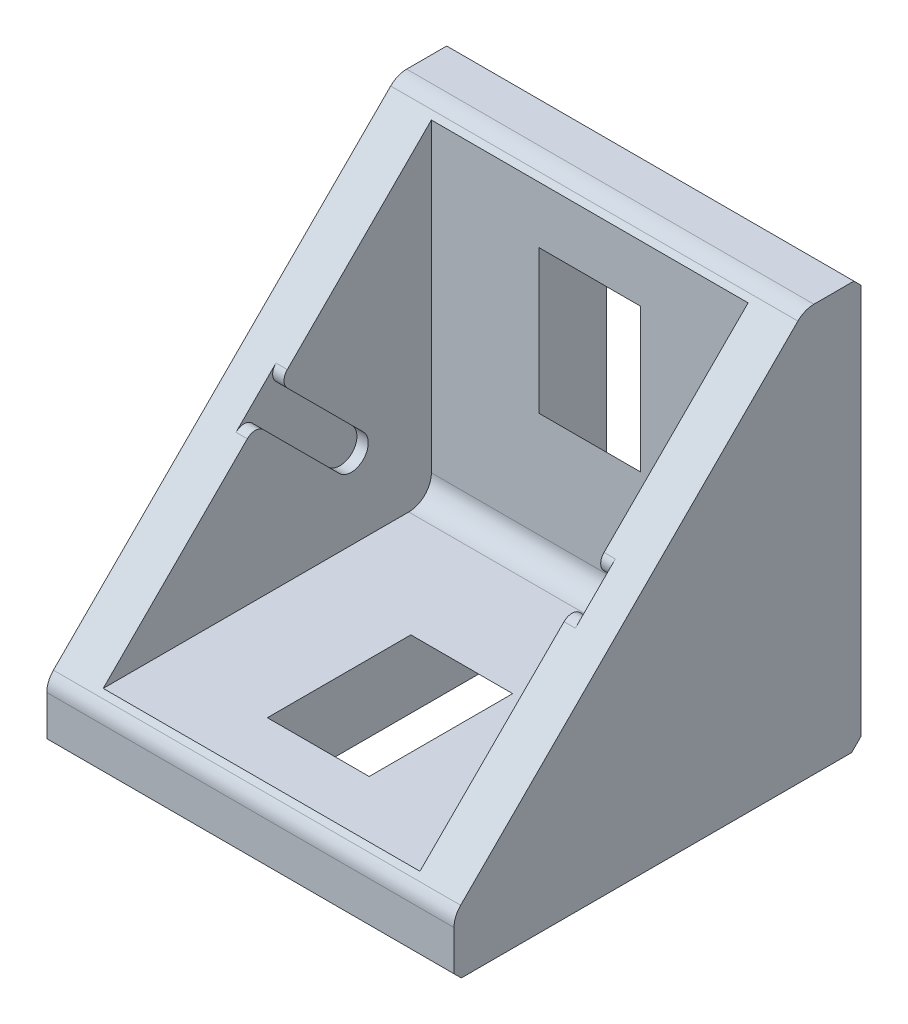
ISO-10303-21;
HEADER;
FILE_DESCRIPTION(('STEP AP214'),'2;1');
FILE_NAME('part.step','',(''),(''),'','','');
FILE_SCHEMA(('AUTOMOTIVE_DESIGN { 1 0 10303 214 1 1 1 1 }'));
ENDSEC;
DATA;
#1=APPLICATION_CONTEXT('core data for automotive mechanical design processes');
#2=APPLICATION_PROTOCOL_DEFINITION('international standard','automotive_design',2000,#1);
#3=PRODUCT_CONTEXT('',#1,'mechanical');
#4=PRODUCT('Part','Part','',(#3));
#5=PRODUCT_RELATED_PRODUCT_CATEGORY('part','',(#4));
#6=PRODUCT_DEFINITION_FORMATION('','',#4);
#7=PRODUCT_DEFINITION_CONTEXT('part definition',#1,'design');
#8=PRODUCT_DEFINITION('design','',#6,#7);
#9=PRODUCT_DEFINITION_SHAPE('','',#8);
#10=(LENGTH_UNIT() NAMED_UNIT(*) SI_UNIT(.MILLI.,.METRE.));
#11=(NAMED_UNIT(*) PLANE_ANGLE_UNIT() SI_UNIT($,.RADIAN.));
#12=(NAMED_UNIT(*) SI_UNIT($,.STERADIAN.) SOLID_ANGLE_UNIT());
#13=UNCERTAINTY_MEASURE_WITH_UNIT(LENGTH_MEASURE(1.E-05),#10,'distance_accuracy_value','');
#14=(GEOMETRIC_REPRESENTATION_CONTEXT(3) GLOBAL_UNCERTAINTY_ASSIGNED_CONTEXT((#13)) GLOBAL_UNIT_ASSIGNED_CONTEXT((#10,
#11,#12)) REPRESENTATION_CONTEXT('',''));
#15=CARTESIAN_POINT('',(0.,0.,0.));
#16=DIRECTION('',(0.,0.,1.));
#17=DIRECTION('',(1.,0.,0.));
#18=AXIS2_PLACEMENT_3D('',#15,#16,#17);
#19=CARTESIAN_POINT('',(7.5,9.01561135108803,10.783378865));
#20=DIRECTION('',(1.,0.,0.));
#21=DIRECTION('',(0.,-1.,0.));
#22=AXIS2_PLACEMENT_3D('',#19,#20,#21);
#23=CYLINDRICAL_SURFACE('',#22,0.500000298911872);
#24=CARTESIAN_POINT('',(-7.,9.01561135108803,10.783378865));
#25=DIRECTION('',(1.,0.,0.));
#26=DIRECTION('',(0.,0.,-1.));
#27=AXIS2_PLACEMENT_3D('',#24,#25,#26);
#28=CIRCLE('',#27,0.500000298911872);
#29=CARTESIAN_POINT('',(-7.,9.3691649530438,10.429825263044));
#30=VERTEX_POINT('',#29);
#31=CARTESIAN_POINT('',(-7.,9.3691649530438,11.136932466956));
#32=VERTEX_POINT('',#31);
#33=EDGE_CURVE('E11',#30,#32,#28,.T.);
#34=ORIENTED_EDGE('',*,*,#33,.F.);
#35=DIRECTION('',(-1.,0.,0.));
#36=VECTOR('',#35,1.);
#37=CARTESIAN_POINT('',(7.5,9.3691649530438,10.429825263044));
#38=LINE('',#37,#36);
#39=CARTESIAN_POINT('',(-7.5,9.3691649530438,10.429825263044));
#40=VERTEX_POINT('',#39);
#41=EDGE_CURVE('E25',#30,#40,#38,.T.);
#42=ORIENTED_EDGE('',*,*,#41,.T.);
#43=CARTESIAN_POINT('',(-7.5,9.01561135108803,10.783378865));
#44=DIRECTION('',(1.,0.,0.));
#45=DIRECTION('',(0.,0.,-1.));
#46=AXIS2_PLACEMENT_3D('',#43,#44,#45);
#47=CIRCLE('',#46,0.500000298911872);
#48=CARTESIAN_POINT('',(-7.5,9.3691649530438,11.136932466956));
#49=VERTEX_POINT('',#48);
#50=EDGE_CURVE('E1755',#40,#49,#47,.T.);
#51=ORIENTED_EDGE('',*,*,#50,.T.);
#52=DIRECTION('',(-1.,0.,0.));
#53=VECTOR('',#52,1.);
#54=CARTESIAN_POINT('',(7.5,9.3691649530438,11.136932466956));
#55=LINE('',#54,#53);
#56=EDGE_CURVE('E1750',#32,#49,#55,.T.);
#57=ORIENTED_EDGE('',*,*,#56,.F.);
#58=EDGE_LOOP('',(#34,#42,#51,#57));
#59=FACE_BOUND('',#58,.T.);
#60=ADVANCED_FACE('F17',(#59),#23,.T.);
#61=CARTESIAN_POINT('',(9.,17.707107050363,2.7989903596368));
#62=DIRECTION('',(0.,-0.707106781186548,-0.707106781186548));
#63=DIRECTION('',(0.,0.707106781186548,-0.707106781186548));
#64=AXIS2_PLACEMENT_3D('',#61,#62,#63);
#65=PLANE('',#64);
#66=DIRECTION('',(0.,-0.707106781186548,0.707106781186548));
#67=VECTOR('',#66,1.);
#68=CARTESIAN_POINT('',(-9.,17.707107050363,2.7989903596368));
#69=LINE('',#68,#67);
#70=CARTESIAN_POINT('',(-9.,17.707107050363,2.7989903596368));
#71=VERTEX_POINT('',#70);
#72=CARTESIAN_POINT('',(-9.,2.7989903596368,17.707107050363));
#73=VERTEX_POINT('',#72);
#74=EDGE_CURVE('E1746',#71,#73,#69,.T.);
#75=ORIENTED_EDGE('',*,*,#74,.T.);
#76=DIRECTION('',(-1.,0.,0.));
#77=VECTOR('',#76,1.);
#78=CARTESIAN_POINT('',(9.,2.7989903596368,17.707107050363));
#79=LINE('',#78,#77);
#80=CARTESIAN_POINT('',(9.,2.7989903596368,17.707107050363));
#81=VERTEX_POINT('',#80);
#82=EDGE_CURVE('E1741',#81,#73,#79,.T.);
#83=ORIENTED_EDGE('',*,*,#82,.F.);
#84=DIRECTION('',(0.,-0.707106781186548,0.707106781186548));
#85=VECTOR('',#84,1.);
#86=CARTESIAN_POINT('',(9.,17.707107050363,2.7989903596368));
#87=LINE('',#86,#85);
#88=CARTESIAN_POINT('',(9.,17.707107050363,2.7989903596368));
#89=VERTEX_POINT('',#88);
#90=EDGE_CURVE('E1736',#89,#81,#87,.T.);
#91=ORIENTED_EDGE('',*,*,#90,.F.);
#92=DIRECTION('',(-1.,0.,0.));
#93=VECTOR('',#92,1.);
#94=CARTESIAN_POINT('',(9.,17.707107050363,2.7989903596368));
#95=LINE('',#94,#93);
#96=EDGE_CURVE('E1732',#89,#71,#95,.T.);
#97=ORIENTED_EDGE('',*,*,#96,.T.);
#98=EDGE_LOOP('',(#75,#83,#91,#97));
#99=FACE_BOUND('',#98,.T.);
#100=DIRECTION('',(-1.,0.,0.));
#101=VECTOR('',#100,1.);
#102=CARTESIAN_POINT('',(7.5,9.3691649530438,11.136932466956));
#103=LINE('',#102,#101);
#104=CARTESIAN_POINT('',(7.5,9.3691649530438,11.136932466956));
#105=VERTEX_POINT('',#104);
#106=CARTESIAN_POINT('',(7.,9.3691649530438,11.136932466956));
#107=VERTEX_POINT('',#106);
#108=EDGE_CURVE('E1728',#105,#107,#103,.T.);
#109=ORIENTED_EDGE('',*,*,#108,.T.);
#110=DIRECTION('',(0.,-0.707106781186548,0.707106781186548));
#111=VECTOR('',#110,1.);
#112=CARTESIAN_POINT('',(7.,17.50609732,3.0000001));
#113=LINE('',#112,#111);
#114=CARTESIAN_POINT('',(7.,3.0000001,17.50609732));
#115=VERTEX_POINT('',#114);
#116=EDGE_CURVE('E1724',#107,#115,#113,.T.);
#117=ORIENTED_EDGE('',*,*,#116,.T.);
#118=DIRECTION('',(-1.,0.,0.));
#119=VECTOR('',#118,1.);
#120=CARTESIAN_POINT('',(7.,3.0000001,17.50609732));
#121=LINE('',#120,#119);
#122=CARTESIAN_POINT('',(-7.,3.0000001,17.50609732));
#123=VERTEX_POINT('',#122);
#124=EDGE_CURVE('E1720',#115,#123,#121,.T.);
#125=ORIENTED_EDGE('',*,*,#124,.T.);
#126=DIRECTION('',(0.,-0.707106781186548,0.707106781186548));
#127=VECTOR('',#126,1.);
#128=CARTESIAN_POINT('',(-7.,17.50609732,3.0000001));
#129=LINE('',#128,#127);
#130=EDGE_CURVE('E1715',#32,#123,#129,.T.);
#131=ORIENTED_EDGE('',*,*,#130,.F.);
#132=ORIENTED_EDGE('',*,*,#56,.T.);
#133=DIRECTION('',(0.,-0.707106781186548,0.707106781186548));
#134=VECTOR('',#133,1.);
#135=CARTESIAN_POINT('',(-7.5,11.136932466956,9.3691649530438));
#136=LINE('',#135,#134);
#137=CARTESIAN_POINT('',(-7.5,11.136932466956,9.3691649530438));
#138=VERTEX_POINT('',#137);
#139=EDGE_CURVE('E1710',#138,#49,#136,.T.);
#140=ORIENTED_EDGE('',*,*,#139,.F.);
#141=DIRECTION('',(-1.,0.,0.));
#142=VECTOR('',#141,1.);
#143=CARTESIAN_POINT('',(7.5,11.136932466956,9.3691649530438));
#144=LINE('',#143,#142);
#145=CARTESIAN_POINT('',(-7.,11.136932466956,9.3691649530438));
#146=VERTEX_POINT('',#145);
#147=EDGE_CURVE('E1705',#146,#138,#144,.T.);
#148=ORIENTED_EDGE('',*,*,#147,.F.);
#149=DIRECTION('',(0.,-0.707106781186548,0.707106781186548));
#150=VECTOR('',#149,1.);
#151=CARTESIAN_POINT('',(-7.,17.50609732,3.0000001));
#152=LINE('',#151,#150);
#153=CARTESIAN_POINT('',(-7.,17.5060973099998,3.0000001));
#154=VERTEX_POINT('',#153);
#155=EDGE_CURVE('E1700',#154,#146,#152,.T.);
#156=ORIENTED_EDGE('',*,*,#155,.F.);
#157=DIRECTION('',(-1.,0.,0.));
#158=VECTOR('',#157,1.);
#159=CARTESIAN_POINT('',(7.,17.50609732,3.0000001));
#160=LINE('',#159,#158);
#161=CARTESIAN_POINT('',(7.,17.50609732,3.0000001));
#162=VERTEX_POINT('',#161);
#163=EDGE_CURVE('E1695',#162,#154,#160,.T.);
#164=ORIENTED_EDGE('',*,*,#163,.F.);
#165=DIRECTION('',(0.,-0.707106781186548,0.707106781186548));
#166=VECTOR('',#165,1.);
#167=CARTESIAN_POINT('',(7.,17.50609732,3.0000001));
#168=LINE('',#167,#166);
#169=CARTESIAN_POINT('',(7.,11.136932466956,9.36916495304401));
#170=VERTEX_POINT('',#169);
#171=EDGE_CURVE('E1691',#162,#170,#168,.T.);
#172=ORIENTED_EDGE('',*,*,#171,.T.);
#173=DIRECTION('',(-1.,0.,0.));
#174=VECTOR('',#173,1.);
#175=CARTESIAN_POINT('',(7.5,11.136932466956,9.3691649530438));
#176=LINE('',#175,#174);
#177=CARTESIAN_POINT('',(7.5,11.136932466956,9.3691649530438));
#178=VERTEX_POINT('',#177);
#179=EDGE_CURVE('E1686',#178,#170,#176,.T.);
#180=ORIENTED_EDGE('',*,*,#179,.F.);
#181=DIRECTION('',(0.,-0.707106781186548,0.707106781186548));
#182=VECTOR('',#181,1.);
#183=CARTESIAN_POINT('',(7.5,11.136932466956,9.3691649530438));
#184=LINE('',#183,#182);
#185=EDGE_CURVE('E1682',#178,#105,#184,.T.);
#186=ORIENTED_EDGE('',*,*,#185,.T.);
#187=EDGE_LOOP('',(#109,#117,#125,#131,#132,#140,#148,#156,#164,#172,#180,#186));
#188=FACE_BOUND('',#187,.T.);
#189=ADVANCED_FACE('F1767',(#99,#188),#65,.F.);
#190=CARTESIAN_POINT('',(7.5,9.01561135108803,10.783378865));
#191=DIRECTION('',(1.,0.,0.));
#192=DIRECTION('',(0.,0.,-1.));
#193=AXIS2_PLACEMENT_3D('',#190,#191,#192);
#194=PLANE('',#193);
#195=ORIENTED_EDGE('',*,*,#185,.F.);
#196=CARTESIAN_POINT('',(7.5,10.783378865,9.01561135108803));
#197=DIRECTION('',(1.,0.,0.));
#198=DIRECTION('',(0.,0.,-1.));
#199=AXIS2_PLACEMENT_3D('',#196,#197,#198);
#200=CIRCLE('',#199,0.500000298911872);
#201=CARTESIAN_POINT('',(7.5,10.429825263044,9.3691649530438));
#202=VERTEX_POINT('',#201);
#203=EDGE_CURVE('E1678',#178,#202,#200,.T.);
#204=ORIENTED_EDGE('',*,*,#203,.T.);
#205=DIRECTION('',(0.,0.707106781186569,0.707106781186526));
#206=VECTOR('',#205,1.);
#207=CARTESIAN_POINT('',(7.5,7.07106815,6.01040784));
#208=LINE('',#207,#206);
#209=CARTESIAN_POINT('',(7.5,7.07106815,6.01040784));
#210=VERTEX_POINT('',#209);
#211=EDGE_CURVE('E1673',#210,#202,#208,.T.);
#212=ORIENTED_EDGE('',*,*,#211,.F.);
#213=CARTESIAN_POINT('',(7.5,6.54073801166,6.54073801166));
#214=DIRECTION('',(1.,0.,0.));
#215=DIRECTION('',(0.,0.,-1.));
#216=AXIS2_PLACEMENT_3D('',#213,#214,#215);
#217=CIRCLE('',#216,0.750000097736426);
#218=CARTESIAN_POINT('',(7.5,6.01040784,7.07106815));
#219=VERTEX_POINT('',#218);
#220=EDGE_CURVE('E1668',#219,#210,#217,.T.);
#221=ORIENTED_EDGE('',*,*,#220,.F.);
#222=DIRECTION('',(0.,-0.707106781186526,-0.707106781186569));
#223=VECTOR('',#222,1.);
#224=CARTESIAN_POINT('',(7.5,9.3691649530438,10.429825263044));
#225=LINE('',#224,#223);
#226=CARTESIAN_POINT('',(7.5,9.3691649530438,10.429825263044));
#227=VERTEX_POINT('',#226);
#228=EDGE_CURVE('E1663',#227,#219,#225,.T.);
#229=ORIENTED_EDGE('',*,*,#228,.F.);
#230=CARTESIAN_POINT('',(7.5,9.01561135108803,10.783378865));
#231=DIRECTION('',(1.,0.,0.));
#232=DIRECTION('',(0.,0.,-1.));
#233=AXIS2_PLACEMENT_3D('',#230,#231,#232);
#234=CIRCLE('',#233,0.500000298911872);
#235=EDGE_CURVE('E1658',#227,#105,#234,.T.);
#236=ORIENTED_EDGE('',*,*,#235,.T.);
#237=EDGE_LOOP('',(#195,#204,#212,#221,#229,#236));
#238=FACE_BOUND('',#237,.T.);
#239=ADVANCED_FACE('F1794',(#238),#194,.F.);
#240=CARTESIAN_POINT('',(7.5,9.01561135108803,10.783378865));
#241=DIRECTION('',(1.,0.,0.));
#242=DIRECTION('',(0.,-1.,0.));
#243=AXIS2_PLACEMENT_3D('',#240,#241,#242);
#244=CYLINDRICAL_SURFACE('',#243,0.500000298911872);
#245=ORIENTED_EDGE('',*,*,#108,.F.);
#246=ORIENTED_EDGE('',*,*,#235,.F.);
#247=DIRECTION('',(-1.,0.,0.));
#248=VECTOR('',#247,1.);
#249=CARTESIAN_POINT('',(7.5,9.3691649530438,10.429825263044));
#250=LINE('',#249,#248);
#251=CARTESIAN_POINT('',(7.,9.3691649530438,10.429825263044));
#252=VERTEX_POINT('',#251);
#253=EDGE_CURVE('E1654',#227,#252,#250,.T.);
#254=ORIENTED_EDGE('',*,*,#253,.T.);
#255=CARTESIAN_POINT('',(7.,9.01561135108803,10.783378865));
#256=DIRECTION('',(1.,0.,0.));
#257=DIRECTION('',(0.,0.,-1.));
#258=AXIS2_PLACEMENT_3D('',#255,#256,#257);
#259=CIRCLE('',#258,0.500000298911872);
#260=EDGE_CURVE('E1649',#252,#107,#259,.T.);
#261=ORIENTED_EDGE('',*,*,#260,.T.);
#262=EDGE_LOOP('',(#245,#246,#254,#261));
#263=FACE_BOUND('',#262,.T.);
#264=ADVANCED_FACE('F1799',(#263),#244,.T.);
#265=CARTESIAN_POINT('',(7.,4.0000001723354,4.0000001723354));
#266=DIRECTION('',(1.,0.,0.));
#267=DIRECTION('',(0.,0.,-1.));
#268=AXIS2_PLACEMENT_3D('',#265,#266,#267);
#269=PLANE('',#268);
#270=ORIENTED_EDGE('',*,*,#116,.F.);
#271=ORIENTED_EDGE('',*,*,#260,.F.);
#272=DIRECTION('',(0.,0.707106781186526,0.707106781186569));
#273=VECTOR('',#272,1.);
#274=CARTESIAN_POINT('',(7.,3.46967001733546,4.53033032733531));
#275=LINE('',#274,#273);
#276=CARTESIAN_POINT('',(7.,6.01040784,7.07106815));
#277=VERTEX_POINT('',#276);
#278=EDGE_CURVE('E1644',#277,#252,#275,.T.);
#279=ORIENTED_EDGE('',*,*,#278,.F.);
#280=CARTESIAN_POINT('',(7.,6.54073801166,6.54073801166));
#281=DIRECTION('',(1.,0.,0.));
#282=DIRECTION('',(0.,0.,-1.));
#283=AXIS2_PLACEMENT_3D('',#280,#281,#282);
#284=CIRCLE('',#283,0.750000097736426);
#285=CARTESIAN_POINT('',(7.,7.07106815,6.01040784));
#286=VERTEX_POINT('',#285);
#287=EDGE_CURVE('E1640',#277,#286,#284,.T.);
#288=ORIENTED_EDGE('',*,*,#287,.T.);
#289=DIRECTION('',(0.,-0.707106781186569,-0.707106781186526));
#290=VECTOR('',#289,1.);
#291=CARTESIAN_POINT('',(7.,4.53033032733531,3.46967001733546));
#292=LINE('',#291,#290);
#293=CARTESIAN_POINT('',(7.,10.429825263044,9.3691649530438));
#294=VERTEX_POINT('',#293);
#295=EDGE_CURVE('E1635',#294,#286,#292,.T.);
#296=ORIENTED_EDGE('',*,*,#295,.F.);
#297=CARTESIAN_POINT('',(7.,10.783378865,9.01561135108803));
#298=DIRECTION('',(1.,0.,0.));
#299=DIRECTION('',(0.,0.,-1.));
#300=AXIS2_PLACEMENT_3D('',#297,#298,#299);
#301=CIRCLE('',#300,0.500000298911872);
#302=EDGE_CURVE('E1630',#170,#294,#301,.T.);
#303=ORIENTED_EDGE('',*,*,#302,.F.);
#304=ORIENTED_EDGE('',*,*,#171,.F.);
#305=DIRECTION('',(0.,1.,0.));
#306=VECTOR('',#305,1.);
#307=CARTESIAN_POINT('',(7.,4.0000001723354,3.0000001));
#308=LINE('',#307,#306);
#309=CARTESIAN_POINT('',(7.,4.0000001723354,3.0000001));
#310=VERTEX_POINT('',#309);
#311=EDGE_CURVE('E1625',#310,#162,#308,.T.);
#312=ORIENTED_EDGE('',*,*,#311,.F.);
#313=CARTESIAN_POINT('',(7.,4.0000001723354,4.0000001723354));
#314=DIRECTION('',(1.,0.,0.));
#315=DIRECTION('',(0.,0.,-1.));
#316=AXIS2_PLACEMENT_3D('',#313,#314,#315);
#317=CIRCLE('',#316,1.0000000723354);
#318=CARTESIAN_POINT('',(7.,3.0000001,4.0000001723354));
#319=VERTEX_POINT('',#318);
#320=EDGE_CURVE('E1620',#319,#310,#317,.T.);
#321=ORIENTED_EDGE('',*,*,#320,.F.);
#322=DIRECTION('',(0.,0.,-1.));
#323=VECTOR('',#322,1.);
#324=CARTESIAN_POINT('',(7.,3.0000001,17.50609732));
#325=LINE('',#324,#323);
#326=EDGE_CURVE('E1615',#115,#319,#325,.T.);
#327=ORIENTED_EDGE('',*,*,#326,.F.);
#328=EDGE_LOOP('',(#270,#271,#279,#288,#296,#303,#304,#312,#321,#327));
#329=FACE_BOUND('',#328,.T.);
#330=ADVANCED_FACE('F1786',(#329),#269,.F.);
#331=CARTESIAN_POINT('',(7.,3.0000001,17.50609732));
#332=DIRECTION('',(0.,1.,0.));
#333=DIRECTION('',(0.,0.,1.));
#334=AXIS2_PLACEMENT_3D('',#331,#332,#333);
#335=PLANE('',#334);
#336=DIRECTION('',(0.,0.,1.));
#337=VECTOR('',#336,1.);
#338=CARTESIAN_POINT('',(2.25,3.0000001,8.65685442));
#339=LINE('',#338,#337);
#340=CARTESIAN_POINT('',(2.25,3.0000001,8.65685442));
#341=VERTEX_POINT('',#340);
#342=CARTESIAN_POINT('',(2.25,3.0000001,15.00000048));
#343=VERTEX_POINT('',#342);
#344=EDGE_CURVE('E1611',#341,#343,#339,.T.);
#345=ORIENTED_EDGE('',*,*,#344,.T.);
#346=DIRECTION('',(-1.,0.,0.));
#347=VECTOR('',#346,1.);
#348=CARTESIAN_POINT('',(2.25,3.0000001,15.00000048));
#349=LINE('',#348,#347);
#350=CARTESIAN_POINT('',(-2.25,3.0000001,15.00000048));
#351=VERTEX_POINT('',#350);
#352=EDGE_CURVE('E1607',#343,#351,#349,.T.);
#353=ORIENTED_EDGE('',*,*,#352,.T.);
#354=DIRECTION('',(0.,0.,1.));
#355=VECTOR('',#354,1.);
#356=CARTESIAN_POINT('',(-2.25,3.0000001,8.65685442));
#357=LINE('',#356,#355);
#358=CARTESIAN_POINT('',(-2.25,3.0000001,8.65685442));
#359=VERTEX_POINT('',#358);
#360=EDGE_CURVE('E1602',#359,#351,#357,.T.);
#361=ORIENTED_EDGE('',*,*,#360,.F.);
#362=DIRECTION('',(-1.,0.,0.));
#363=VECTOR('',#362,1.);
#364=CARTESIAN_POINT('',(2.25,3.0000001,8.65685442));
#365=LINE('',#364,#363);
#366=EDGE_CURVE('E1597',#341,#359,#365,.T.);
#367=ORIENTED_EDGE('',*,*,#366,.F.);
#368=EDGE_LOOP('',(#345,#353,#361,#367));
#369=FACE_BOUND('',#368,.T.);
#370=DIRECTION('',(0.,0.,-1.));
#371=VECTOR('',#370,1.);
#372=CARTESIAN_POINT('',(-7.,3.0000001,17.50609732));
#373=LINE('',#372,#371);
#374=CARTESIAN_POINT('',(-7.,3.0000001,4.0000001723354));
#375=VERTEX_POINT('',#374);
#376=EDGE_CURVE('E1592',#123,#375,#373,.T.);
#377=ORIENTED_EDGE('',*,*,#376,.F.);
#378=ORIENTED_EDGE('',*,*,#124,.F.);
#379=ORIENTED_EDGE('',*,*,#326,.T.);
#380=DIRECTION('',(-1.,0.,0.));
#381=VECTOR('',#380,1.);
#382=CARTESIAN_POINT('',(7.,3.0000001,4.0000001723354));
#383=LINE('',#382,#381);
#384=EDGE_CURVE('E1588',#319,#375,#383,.T.);
#385=ORIENTED_EDGE('',*,*,#384,.T.);
#386=EDGE_LOOP('',(#377,#378,#379,#385));
#387=FACE_BOUND('',#386,.T.);
#388=ADVANCED_FACE('F1806',(#369,#387),#335,.T.);
#389=CARTESIAN_POINT('',(7.,4.0000001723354,4.0000001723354));
#390=DIRECTION('',(1.,0.,0.));
#391=DIRECTION('',(0.,0.707106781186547,0.707106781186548));
#392=AXIS2_PLACEMENT_3D('',#389,#390,#391);
#393=CYLINDRICAL_SURFACE('',#392,1.0000000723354);
#394=DIRECTION('',(-1.,0.,0.));
#395=VECTOR('',#394,1.);
#396=CARTESIAN_POINT('',(7.,4.0000001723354,3.0000001));
#397=LINE('',#396,#395);
#398=CARTESIAN_POINT('',(-7.,4.0000001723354,3.0000001));
#399=VERTEX_POINT('',#398);
#400=EDGE_CURVE('E1584',#310,#399,#397,.T.);
#401=ORIENTED_EDGE('',*,*,#400,.T.);
#402=CARTESIAN_POINT('',(-7.,4.0000001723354,4.0000001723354));
#403=DIRECTION('',(1.,0.,0.));
#404=DIRECTION('',(0.,0.,-1.));
#405=AXIS2_PLACEMENT_3D('',#402,#403,#404);
#406=CIRCLE('',#405,1.0000000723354);
#407=EDGE_CURVE('E1579',#375,#399,#406,.T.);
#408=ORIENTED_EDGE('',*,*,#407,.F.);
#409=ORIENTED_EDGE('',*,*,#384,.F.);
#410=ORIENTED_EDGE('',*,*,#320,.T.);
#411=EDGE_LOOP('',(#401,#408,#409,#410));
#412=FACE_BOUND('',#411,.T.);
#413=ADVANCED_FACE('F1843',(#412),#393,.F.);
#414=CARTESIAN_POINT('',(-7.,4.0000001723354,4.0000001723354));
#415=DIRECTION('',(1.,0.,0.));
#416=DIRECTION('',(0.,0.,-1.));
#417=AXIS2_PLACEMENT_3D('',#414,#415,#416);
#418=PLANE('',#417);
#419=ORIENTED_EDGE('',*,*,#33,.T.);
#420=ORIENTED_EDGE('',*,*,#130,.T.);
#421=ORIENTED_EDGE('',*,*,#376,.T.);
#422=ORIENTED_EDGE('',*,*,#407,.T.);
#423=DIRECTION('',(0.,1.,0.));
#424=VECTOR('',#423,1.);
#425=CARTESIAN_POINT('',(-7.,4.0000001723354,3.0000001));
#426=LINE('',#425,#424);
#427=EDGE_CURVE('E1574',#399,#154,#426,.T.);
#428=ORIENTED_EDGE('',*,*,#427,.T.);
#429=ORIENTED_EDGE('',*,*,#155,.T.);
#430=CARTESIAN_POINT('',(-7.,10.783378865,9.01561135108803));
#431=DIRECTION('',(1.,0.,0.));
#432=DIRECTION('',(0.,0.,-1.));
#433=AXIS2_PLACEMENT_3D('',#430,#431,#432);
#434=CIRCLE('',#433,0.500000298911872);
#435=CARTESIAN_POINT('',(-7.,10.429825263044,9.3691649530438));
#436=VERTEX_POINT('',#435);
#437=EDGE_CURVE('E1570',#146,#436,#434,.T.);
#438=ORIENTED_EDGE('',*,*,#437,.T.);
#439=DIRECTION('',(0.,-0.707106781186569,-0.707106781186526));
#440=VECTOR('',#439,1.);
#441=CARTESIAN_POINT('',(-7.,4.53033032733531,3.46967001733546));
#442=LINE('',#441,#440);
#443=CARTESIAN_POINT('',(-7.,7.07106815,6.01040784));
#444=VERTEX_POINT('',#443);
#445=EDGE_CURVE('E1566',#436,#444,#442,.T.);
#446=ORIENTED_EDGE('',*,*,#445,.T.);
#447=CARTESIAN_POINT('',(-7.,6.54073801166,6.54073801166));
#448=DIRECTION('',(1.,0.,0.));
#449=DIRECTION('',(0.,0.,-1.));
#450=AXIS2_PLACEMENT_3D('',#447,#448,#449);
#451=CIRCLE('',#450,0.750000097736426);
#452=CARTESIAN_POINT('',(-7.,6.01040784,7.07106815));
#453=VERTEX_POINT('',#452);
#454=EDGE_CURVE('E1561',#453,#444,#451,.T.);
#455=ORIENTED_EDGE('',*,*,#454,.F.);
#456=DIRECTION('',(0.,0.707106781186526,0.707106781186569));
#457=VECTOR('',#456,1.);
#458=CARTESIAN_POINT('',(-7.,3.46967001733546,4.53033032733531));
#459=LINE('',#458,#457);
#460=EDGE_CURVE('E1557',#453,#30,#459,.T.);
#461=ORIENTED_EDGE('',*,*,#460,.T.);
#462=EDGE_LOOP('',(#419,#420,#421,#422,#428,#429,#438,#446,#455,#461));
#463=FACE_BOUND('',#462,.T.);
#464=ADVANCED_FACE('F1776',(#463),#418,.T.);
#465=CARTESIAN_POINT('',(7.5,9.3691649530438,10.429825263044));
#466=DIRECTION('',(0.,0.707106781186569,-0.707106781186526));
#467=DIRECTION('',(0.,0.707106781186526,0.707106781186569));
#468=AXIS2_PLACEMENT_3D('',#465,#466,#467);
#469=PLANE('',#468);
#470=DIRECTION('',(-1.,0.,0.));
#471=VECTOR('',#470,1.);
#472=CARTESIAN_POINT('',(7.5,6.01040784,7.07106815));
#473=LINE('',#472,#471);
#474=CARTESIAN_POINT('',(-7.5,6.01040784,7.07106815));
#475=VERTEX_POINT('',#474);
#476=EDGE_CURVE('E1553',#453,#475,#473,.T.);
#477=ORIENTED_EDGE('',*,*,#476,.T.);
#478=DIRECTION('',(0.,-0.707106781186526,-0.707106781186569));
#479=VECTOR('',#478,1.);
#480=CARTESIAN_POINT('',(-7.5,9.3691649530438,10.429825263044));
#481=LINE('',#480,#479);
#482=EDGE_CURVE('E1548',#40,#475,#481,.T.);
#483=ORIENTED_EDGE('',*,*,#482,.F.);
#484=ORIENTED_EDGE('',*,*,#41,.F.);
#485=ORIENTED_EDGE('',*,*,#460,.F.);
#486=EDGE_LOOP('',(#477,#483,#484,#485));
#487=FACE_BOUND('',#486,.T.);
#488=ADVANCED_FACE('F1810',(#487),#469,.T.);
#489=CARTESIAN_POINT('',(-7.5,9.01561135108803,10.783378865));
#490=DIRECTION('',(1.,0.,0.));
#491=DIRECTION('',(0.,0.,-1.));
#492=AXIS2_PLACEMENT_3D('',#489,#490,#491);
#493=PLANE('',#492);
#494=ORIENTED_EDGE('',*,*,#139,.T.);
#495=ORIENTED_EDGE('',*,*,#50,.F.);
#496=ORIENTED_EDGE('',*,*,#482,.T.);
#497=CARTESIAN_POINT('',(-7.5,6.54073801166,6.54073801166));
#498=DIRECTION('',(1.,0.,0.));
#499=DIRECTION('',(0.,0.,-1.));
#500=AXIS2_PLACEMENT_3D('',#497,#498,#499);
#501=CIRCLE('',#500,0.750000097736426);
#502=CARTESIAN_POINT('',(-7.5,7.07106815,6.01040784));
#503=VERTEX_POINT('',#502);
#504=EDGE_CURVE('E1544',#475,#503,#501,.T.);
#505=ORIENTED_EDGE('',*,*,#504,.T.);
#506=DIRECTION('',(0.,0.707106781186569,0.707106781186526));
#507=VECTOR('',#506,1.);
#508=CARTESIAN_POINT('',(-7.5,7.07106815,6.01040784));
#509=LINE('',#508,#507);
#510=CARTESIAN_POINT('',(-7.5,10.429825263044,9.3691649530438));
#511=VERTEX_POINT('',#510);
#512=EDGE_CURVE('E1540',#503,#511,#509,.T.);
#513=ORIENTED_EDGE('',*,*,#512,.T.);
#514=CARTESIAN_POINT('',(-7.5,10.783378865,9.01561135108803));
#515=DIRECTION('',(1.,0.,0.));
#516=DIRECTION('',(0.,0.,-1.));
#517=AXIS2_PLACEMENT_3D('',#514,#515,#516);
#518=CIRCLE('',#517,0.500000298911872);
#519=EDGE_CURVE('E1535',#138,#511,#518,.T.);
#520=ORIENTED_EDGE('',*,*,#519,.F.);
#521=EDGE_LOOP('',(#494,#495,#496,#505,#513,#520));
#522=FACE_BOUND('',#521,.T.);
#523=ADVANCED_FACE('F1769',(#522),#493,.T.);
#524=CARTESIAN_POINT('',(7.5,10.783378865,9.01561135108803));
#525=DIRECTION('',(1.,0.,0.));
#526=DIRECTION('',(0.,0.,-1.));
#527=AXIS2_PLACEMENT_3D('',#524,#525,#526);
#528=CYLINDRICAL_SURFACE('',#527,0.500000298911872);
#529=ORIENTED_EDGE('',*,*,#437,.F.);
#530=ORIENTED_EDGE('',*,*,#147,.T.);
#531=ORIENTED_EDGE('',*,*,#519,.T.);
#532=DIRECTION('',(-1.,0.,0.));
#533=VECTOR('',#532,1.);
#534=CARTESIAN_POINT('',(7.5,10.429825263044,9.3691649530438));
#535=LINE('',#534,#533);
#536=EDGE_CURVE('E1530',#436,#511,#535,.T.);
#537=ORIENTED_EDGE('',*,*,#536,.F.);
#538=EDGE_LOOP('',(#529,#530,#531,#537));
#539=FACE_BOUND('',#538,.T.);
#540=ADVANCED_FACE('F1774',(#539),#528,.T.);
#541=CARTESIAN_POINT('',(7.5,7.07106815,6.01040784));
#542=DIRECTION('',(0.,-0.707106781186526,0.707106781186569));
#543=DIRECTION('',(0.,-0.707106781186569,-0.707106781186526));
#544=AXIS2_PLACEMENT_3D('',#541,#542,#543);
#545=PLANE('',#544);
#546=ORIENTED_EDGE('',*,*,#536,.T.);
#547=ORIENTED_EDGE('',*,*,#512,.F.);
#548=DIRECTION('',(-1.,0.,0.));
#549=VECTOR('',#548,1.);
#550=CARTESIAN_POINT('',(7.5,7.07106815,6.01040784));
#551=LINE('',#550,#549);
#552=EDGE_CURVE('E1525',#444,#503,#551,.T.);
#553=ORIENTED_EDGE('',*,*,#552,.F.);
#554=ORIENTED_EDGE('',*,*,#445,.F.);
#555=EDGE_LOOP('',(#546,#547,#553,#554));
#556=FACE_BOUND('',#555,.T.);
#557=ADVANCED_FACE('F1817',(#556),#545,.T.);
#558=CARTESIAN_POINT('',(7.5,6.54073801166,6.54073801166));
#559=DIRECTION('',(1.,0.,0.));
#560=DIRECTION('',(0.,0.707106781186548,0.707106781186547));
#561=AXIS2_PLACEMENT_3D('',#558,#559,#560);
#562=CYLINDRICAL_SURFACE('',#561,0.750000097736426);
#563=ORIENTED_EDGE('',*,*,#454,.T.);
#564=ORIENTED_EDGE('',*,*,#552,.T.);
#565=ORIENTED_EDGE('',*,*,#504,.F.);
#566=ORIENTED_EDGE('',*,*,#476,.F.);
#567=EDGE_LOOP('',(#563,#564,#565,#566));
#568=FACE_BOUND('',#567,.T.);
#569=ADVANCED_FACE('F1813',(#568),#562,.F.);
#570=CARTESIAN_POINT('',(7.,4.0000001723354,3.0000001));
#571=DIRECTION('',(0.,0.,1.));
#572=DIRECTION('',(1.,0.,0.));
#573=AXIS2_PLACEMENT_3D('',#570,#571,#572);
#574=PLANE('',#573);
#575=DIRECTION('',(0.,-1.,0.));
#576=VECTOR('',#575,1.);
#577=CARTESIAN_POINT('',(2.25,15.00000048,3.0000001));
#578=LINE('',#577,#576);
#579=CARTESIAN_POINT('',(2.25,15.00000048,3.0000001));
#580=VERTEX_POINT('',#579);
#581=CARTESIAN_POINT('',(2.25,8.65685442,3.0000001));
#582=VERTEX_POINT('',#581);
#583=EDGE_CURVE('E1521',#580,#582,#578,.T.);
#584=ORIENTED_EDGE('',*,*,#583,.T.);
#585=DIRECTION('',(-1.,0.,0.));
#586=VECTOR('',#585,1.);
#587=CARTESIAN_POINT('',(2.25,8.65685442,3.0000001));
#588=LINE('',#587,#586);
#589=CARTESIAN_POINT('',(-2.25,8.65685442,3.0000001));
#590=VERTEX_POINT('',#589);
#591=EDGE_CURVE('E1517',#582,#590,#588,.T.);
#592=ORIENTED_EDGE('',*,*,#591,.T.);
#593=DIRECTION('',(0.,-1.,0.));
#594=VECTOR('',#593,1.);
#595=CARTESIAN_POINT('',(-2.25,15.00000048,3.0000001));
#596=LINE('',#595,#594);
#597=CARTESIAN_POINT('',(-2.25,15.00000048,3.0000001));
#598=VERTEX_POINT('',#597);
#599=EDGE_CURVE('E1512',#598,#590,#596,.T.);
#600=ORIENTED_EDGE('',*,*,#599,.F.);
#601=DIRECTION('',(-1.,0.,0.));
#602=VECTOR('',#601,1.);
#603=CARTESIAN_POINT('',(2.25,15.00000048,3.0000001));
#604=LINE('',#603,#602);
#605=EDGE_CURVE('E1507',#580,#598,#604,.T.);
#606=ORIENTED_EDGE('',*,*,#605,.F.);
#607=EDGE_LOOP('',(#584,#592,#600,#606));
#608=FACE_BOUND('',#607,.T.);
#609=ORIENTED_EDGE('',*,*,#427,.F.);
#610=ORIENTED_EDGE('',*,*,#400,.F.);
#611=ORIENTED_EDGE('',*,*,#311,.T.);
#612=ORIENTED_EDGE('',*,*,#163,.T.);
#613=EDGE_LOOP('',(#609,#610,#611,#612));
#614=FACE_BOUND('',#613,.T.);
#615=ADVANCED_FACE('F1781',(#608,#614),#574,.T.);
#616=CARTESIAN_POINT('',(2.25,15.00000048,0.15075764));
#617=DIRECTION('',(0.,-1.,0.));
#618=DIRECTION('',(0.,0.,-1.));
#619=AXIS2_PLACEMENT_3D('',#616,#617,#618);
#620=PLANE('',#619);
#621=DIRECTION('',(0.,0.,1.));
#622=VECTOR('',#621,1.);
#623=CARTESIAN_POINT('',(-2.25,15.00000048,0.15075764));
#624=LINE('',#623,#622);
#625=CARTESIAN_POINT('',(-2.25,15.00000048,0.15075764));
#626=VERTEX_POINT('',#625);
#627=EDGE_CURVE('E1502',#626,#598,#624,.T.);
#628=ORIENTED_EDGE('',*,*,#627,.F.);
#629=DIRECTION('',(-1.,0.,0.));
#630=VECTOR('',#629,1.);
#631=CARTESIAN_POINT('',(2.25,15.00000048,0.15075764));
#632=LINE('',#631,#630);
#633=CARTESIAN_POINT('',(2.25,15.00000048,0.15075764));
#634=VERTEX_POINT('',#633);
#635=EDGE_CURVE('E1497',#634,#626,#632,.T.);
#636=ORIENTED_EDGE('',*,*,#635,.F.);
#637=DIRECTION('',(0.,0.,1.));
#638=VECTOR('',#637,1.);
#639=CARTESIAN_POINT('',(2.25,15.00000048,0.15075764));
#640=LINE('',#639,#638);
#641=EDGE_CURVE('E1492',#634,#580,#640,.T.);
#642=ORIENTED_EDGE('',*,*,#641,.T.);
#643=ORIENTED_EDGE('',*,*,#605,.T.);
#644=EDGE_LOOP('',(#628,#636,#642,#643));
#645=FACE_BOUND('',#644,.T.);
#646=ADVANCED_FACE('F1884',(#645),#620,.T.);
#647=CARTESIAN_POINT('',(2.25,0.,0.));
#648=DIRECTION('',(1.,0.,0.));
#649=DIRECTION('',(0.,0.,-1.));
#650=AXIS2_PLACEMENT_3D('',#647,#648,#649);
#651=PLANE('',#650);
#652=ORIENTED_EDGE('',*,*,#641,.F.);
#653=DIRECTION('',(0.,0.707106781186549,0.707106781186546));
#654=VECTOR('',#653,1.);
#655=CARTESIAN_POINT('',(2.25,14.84924284,0.));
#656=LINE('',#655,#654);
#657=CARTESIAN_POINT('',(2.25,14.84924284,0.));
#658=VERTEX_POINT('',#657);
#659=EDGE_CURVE('E1487',#658,#634,#656,.T.);
#660=ORIENTED_EDGE('',*,*,#659,.F.);
#661=DIRECTION('',(0.,1.,0.));
#662=VECTOR('',#661,1.);
#663=CARTESIAN_POINT('',(2.25,5.65685432,0.));
#664=LINE('',#663,#662);
#665=CARTESIAN_POINT('',(2.25,5.65685432,0.));
#666=VERTEX_POINT('',#665);
#667=EDGE_CURVE('E1482',#666,#658,#664,.T.);
#668=ORIENTED_EDGE('',*,*,#667,.F.);
#669=DIRECTION('',(0.,-0.707106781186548,-0.707106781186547));
#670=VECTOR('',#669,1.);
#671=CARTESIAN_POINT('',(2.25,8.65685442,3.0000001));
#672=LINE('',#671,#670);
#673=EDGE_CURVE('E1477',#582,#666,#672,.T.);
#674=ORIENTED_EDGE('',*,*,#673,.F.);
#675=ORIENTED_EDGE('',*,*,#583,.F.);
#676=EDGE_LOOP('',(#652,#660,#668,#674,#675));
#677=FACE_BOUND('',#676,.T.);
#678=ADVANCED_FACE('F1894',(#677),#651,.F.);
#679=CARTESIAN_POINT('',(2.25,8.65685442,3.0000001));
#680=DIRECTION('',(0.,0.707106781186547,-0.707106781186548));
#681=DIRECTION('',(0.,0.707106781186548,0.707106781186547));
#682=AXIS2_PLACEMENT_3D('',#679,#680,#681);
#683=PLANE('',#682);
#684=DIRECTION('',(0.,-0.707106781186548,-0.707106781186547));
#685=VECTOR('',#684,1.);
#686=CARTESIAN_POINT('',(-2.25,8.65685442,3.0000001));
#687=LINE('',#686,#685);
#688=CARTESIAN_POINT('',(-2.25,5.65685432,0.));
#689=VERTEX_POINT('',#688);
#690=EDGE_CURVE('E1472',#590,#689,#687,.T.);
#691=ORIENTED_EDGE('',*,*,#690,.F.);
#692=ORIENTED_EDGE('',*,*,#591,.F.);
#693=ORIENTED_EDGE('',*,*,#673,.T.);
#694=DIRECTION('',(-1.,0.,0.));
#695=VECTOR('',#694,1.);
#696=CARTESIAN_POINT('',(2.25,5.65685432,0.));
#697=LINE('',#696,#695);
#698=EDGE_CURVE('E1468',#666,#689,#697,.T.);
#699=ORIENTED_EDGE('',*,*,#698,.T.);
#700=EDGE_LOOP('',(#691,#692,#693,#699));
#701=FACE_BOUND('',#700,.T.);
#702=ADVANCED_FACE('F1904',(#701),#683,.T.);
#703=CARTESIAN_POINT('',(9.,0.42426407,0.));
#704=DIRECTION('',(0.,0.,1.));
#705=DIRECTION('',(1.,0.,0.));
#706=AXIS2_PLACEMENT_3D('',#703,#704,#705);
#707=PLANE('',#706);
#708=DIRECTION('',(-1.,0.,0.));
#709=VECTOR('',#708,1.);
#710=CARTESIAN_POINT('',(7.35000028,4.24264074,0.));
#711=LINE('',#710,#709);
#712=CARTESIAN_POINT('',(7.35000028,4.24264074,0.));
#713=VERTEX_POINT('',#712);
#714=CARTESIAN_POINT('',(3.85000017,4.24264074,0.));
#715=VERTEX_POINT('',#714);
#716=EDGE_CURVE('E1463',#713,#715,#711,.T.);
#717=ORIENTED_EDGE('',*,*,#716,.F.);
#718=DIRECTION('',(0.,-1.,0.));
#719=VECTOR('',#718,1.);
#720=CARTESIAN_POINT('',(7.35000028,14.00000045,0.));
#721=LINE('',#720,#719);
#722=CARTESIAN_POINT('',(7.35000028,14.00000045,0.));
#723=VERTEX_POINT('',#722);
#724=EDGE_CURVE('E1459',#723,#713,#721,.T.);
#725=ORIENTED_EDGE('',*,*,#724,.F.);
#726=DIRECTION('',(-1.,0.,0.));
#727=VECTOR('',#726,1.);
#728=CARTESIAN_POINT('',(7.35000028,14.00000045,0.));
#729=LINE('',#728,#727);
#730=CARTESIAN_POINT('',(3.85000017,14.00000045,0.));
#731=VERTEX_POINT('',#730);
#732=EDGE_CURVE('E569',#723,#731,#729,.T.);
#733=ORIENTED_EDGE('',*,*,#732,.T.);
#734=DIRECTION('',(0.,-1.,0.));
#735=VECTOR('',#734,1.);
#736=CARTESIAN_POINT('',(3.85000017,14.00000045,0.));
#737=LINE('',#736,#735);
#738=EDGE_CURVE('E1452',#731,#715,#737,.T.);
#739=ORIENTED_EDGE('',*,*,#738,.T.);
#740=EDGE_LOOP('',(#717,#725,#733,#739));
#741=FACE_BOUND('',#740,.T.);
#742=DIRECTION('',(-1.,0.,0.));
#743=VECTOR('',#742,1.);
#744=CARTESIAN_POINT('',(-3.85000018,4.24264074,0.));
#745=LINE('',#744,#743);
#746=CARTESIAN_POINT('',(-3.85000018,4.24264074,0.));
#747=VERTEX_POINT('',#746);
#748=CARTESIAN_POINT('',(-7.35000029,4.24264074,0.));
#749=VERTEX_POINT('',#748);
#750=EDGE_CURVE('E1447',#747,#749,#745,.T.);
#751=ORIENTED_EDGE('',*,*,#750,.F.);
#752=DIRECTION('',(0.,-1.,0.));
#753=VECTOR('',#752,1.);
#754=CARTESIAN_POINT('',(-3.85000018,14.00000045,0.));
#755=LINE('',#754,#753);
#756=CARTESIAN_POINT('',(-3.85000018,14.00000045,0.));
#757=VERTEX_POINT('',#756);
#758=EDGE_CURVE('E1442',#757,#747,#755,.T.);
#759=ORIENTED_EDGE('',*,*,#758,.F.);
#760=DIRECTION('',(-1.,0.,0.));
#761=VECTOR('',#760,1.);
#762=CARTESIAN_POINT('',(-3.85000018,14.00000045,0.));
#763=LINE('',#762,#761);
#764=CARTESIAN_POINT('',(-7.35000029,14.00000045,0.));
#765=VERTEX_POINT('',#764);
#766=EDGE_CURVE('E1438',#757,#765,#763,.T.);
#767=ORIENTED_EDGE('',*,*,#766,.T.);
#768=DIRECTION('',(0.,-1.,0.));
#769=VECTOR('',#768,1.);
#770=CARTESIAN_POINT('',(-7.35000029,14.00000045,0.));
#771=LINE('',#770,#769);
#772=EDGE_CURVE('E1434',#765,#749,#771,.T.);
#773=ORIENTED_EDGE('',*,*,#772,.T.);
#774=EDGE_LOOP('',(#751,#759,#767,#773));
#775=FACE_BOUND('',#774,.T.);
#776=ORIENTED_EDGE('',*,*,#698,.F.);
#777=ORIENTED_EDGE('',*,*,#667,.T.);
#778=DIRECTION('',(-1.,0.,0.));
#779=VECTOR('',#778,1.);
#780=CARTESIAN_POINT('',(4.,14.84924284,0.));
#781=LINE('',#780,#779);
#782=CARTESIAN_POINT('',(4.,14.84924284,0.));
#783=VERTEX_POINT('',#782);
#784=EDGE_CURVE('E1429',#783,#658,#781,.T.);
#785=ORIENTED_EDGE('',*,*,#784,.F.);
#786=DIRECTION('',(0.,1.,0.));
#787=VECTOR('',#786,1.);
#788=CARTESIAN_POINT('',(4.,14.84924284,0.));
#789=LINE('',#788,#787);
#790=CARTESIAN_POINT('',(4.,17.67767,0.));
#791=VERTEX_POINT('',#790);
#792=EDGE_CURVE('E1425',#783,#791,#789,.T.);
#793=ORIENTED_EDGE('',*,*,#792,.T.);
#794=DIRECTION('',(-1.,0.,0.));
#795=VECTOR('',#794,1.);
#796=CARTESIAN_POINT('',(9.,17.67767,0.));
#797=LINE('',#796,#795);
#798=CARTESIAN_POINT('',(9.,17.67767,0.));
#799=VERTEX_POINT('',#798);
#800=EDGE_CURVE('E1420',#799,#791,#797,.T.);
#801=ORIENTED_EDGE('',*,*,#800,.F.);
#802=DIRECTION('',(0.,1.,0.));
#803=VECTOR('',#802,1.);
#804=CARTESIAN_POINT('',(9.,0.42426407,0.));
#805=LINE('',#804,#803);
#806=CARTESIAN_POINT('',(9.,0.42426407,0.));
#807=VERTEX_POINT('',#806);
#808=EDGE_CURVE('E1415',#807,#799,#805,.T.);
#809=ORIENTED_EDGE('',*,*,#808,.F.);
#810=DIRECTION('',(-1.,0.,0.));
#811=VECTOR('',#810,1.);
#812=CARTESIAN_POINT('',(9.,0.42426407,0.));
#813=LINE('',#812,#811);
#814=CARTESIAN_POINT('',(7.,0.42426407,0.));
#815=VERTEX_POINT('',#814);
#816=EDGE_CURVE('E1411',#807,#815,#813,.T.);
#817=ORIENTED_EDGE('',*,*,#816,.T.);
#818=DIRECTION('',(0.,1.,0.));
#819=VECTOR('',#818,1.);
#820=CARTESIAN_POINT('',(7.,0.42426407,0.));
#821=LINE('',#820,#819);
#822=CARTESIAN_POINT('',(7.,2.12132037,0.));
#823=VERTEX_POINT('',#822);
#824=EDGE_CURVE('E1407',#815,#823,#821,.T.);
#825=ORIENTED_EDGE('',*,*,#824,.T.);
#826=DIRECTION('',(-1.,0.,0.));
#827=VECTOR('',#826,1.);
#828=CARTESIAN_POINT('',(7.,2.12132037,0.));
#829=LINE('',#828,#827);
#830=CARTESIAN_POINT('',(4.,2.12132037,0.));
#831=VERTEX_POINT('',#830);
#832=EDGE_CURVE('E1403',#823,#831,#829,.T.);
#833=ORIENTED_EDGE('',*,*,#832,.T.);
#834=DIRECTION('',(0.,1.,0.));
#835=VECTOR('',#834,1.);
#836=CARTESIAN_POINT('',(4.,2.12132037,0.));
#837=LINE('',#836,#835);
#838=CARTESIAN_POINT('',(4.,3.53553395,0.));
#839=VERTEX_POINT('',#838);
#840=EDGE_CURVE('E1399',#831,#839,#837,.T.);
#841=ORIENTED_EDGE('',*,*,#840,.T.);
#842=DIRECTION('',(-1.,0.,0.));
#843=VECTOR('',#842,1.);
#844=CARTESIAN_POINT('',(4.,3.53553395,0.));
#845=LINE('',#844,#843);
#846=CARTESIAN_POINT('',(3.,3.53553395,0.));
#847=VERTEX_POINT('',#846);
#848=EDGE_CURVE('E1395',#839,#847,#845,.T.);
#849=ORIENTED_EDGE('',*,*,#848,.T.);
#850=DIRECTION('',(-1.,0.,0.));
#851=VECTOR('',#850,1.);
#852=CARTESIAN_POINT('',(4.,3.53553395,0.));
#853=LINE('',#852,#851);
#854=CARTESIAN_POINT('',(-3.,3.53553421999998,-2.70000027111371E-07));
#855=VERTEX_POINT('',#854);
#856=EDGE_CURVE('E1391',#847,#855,#853,.T.);
#857=ORIENTED_EDGE('',*,*,#856,.T.);
#858=DIRECTION('',(-1.,0.,0.));
#859=VECTOR('',#858,1.);
#860=CARTESIAN_POINT('',(4.,3.53553395,0.));
#861=LINE('',#860,#859);
#862=CARTESIAN_POINT('',(-4.,3.53553395,0.));
#863=VERTEX_POINT('',#862);
#864=EDGE_CURVE('E1387',#855,#863,#861,.T.);
#865=ORIENTED_EDGE('',*,*,#864,.T.);
#866=DIRECTION('',(0.,1.,0.));
#867=VECTOR('',#866,1.);
#868=CARTESIAN_POINT('',(-4.,2.12132037,0.));
#869=LINE('',#868,#867);
#870=CARTESIAN_POINT('',(-4.,2.12132037,0.));
#871=VERTEX_POINT('',#870);
#872=EDGE_CURVE('E1382',#871,#863,#869,.T.);
#873=ORIENTED_EDGE('',*,*,#872,.F.);
#874=DIRECTION('',(-1.,0.,0.));
#875=VECTOR('',#874,1.);
#876=CARTESIAN_POINT('',(7.,2.12132037,0.));
#877=LINE('',#876,#875);
#878=CARTESIAN_POINT('',(-7.,2.12132037,0.));
#879=VERTEX_POINT('',#878);
#880=EDGE_CURVE('E1378',#871,#879,#877,.T.);
#881=ORIENTED_EDGE('',*,*,#880,.T.);
#882=DIRECTION('',(0.,1.,0.));
#883=VECTOR('',#882,1.);
#884=CARTESIAN_POINT('',(-7.,0.42426407,0.));
#885=LINE('',#884,#883);
#886=CARTESIAN_POINT('',(-7.,0.42426407,0.));
#887=VERTEX_POINT('',#886);
#888=EDGE_CURVE('E1373',#887,#879,#885,.T.);
#889=ORIENTED_EDGE('',*,*,#888,.F.);
#890=DIRECTION('',(-1.,0.,0.));
#891=VECTOR('',#890,1.);
#892=CARTESIAN_POINT('',(9.,0.42426407,0.));
#893=LINE('',#892,#891);
#894=CARTESIAN_POINT('',(-9.,0.42426407,0.));
#895=VERTEX_POINT('',#894);
#896=EDGE_CURVE('E1369',#887,#895,#893,.T.);
#897=ORIENTED_EDGE('',*,*,#896,.T.);
#898=DIRECTION('',(0.,1.,0.));
#899=VECTOR('',#898,1.);
#900=CARTESIAN_POINT('',(-9.,0.42426407,0.));
#901=LINE('',#900,#899);
#902=CARTESIAN_POINT('',(-9.,17.67767,0.));
#903=VERTEX_POINT('',#902);
#904=EDGE_CURVE('E1365',#895,#903,#901,.T.);
#905=ORIENTED_EDGE('',*,*,#904,.T.);
#906=DIRECTION('',(-1.,0.,0.));
#907=VECTOR('',#906,1.);
#908=CARTESIAN_POINT('',(9.,17.67767,0.));
#909=LINE('',#908,#907);
#910=CARTESIAN_POINT('',(-4.,17.67767,0.));
#911=VERTEX_POINT('',#910);
#912=EDGE_CURVE('E1360',#911,#903,#909,.T.);
#913=ORIENTED_EDGE('',*,*,#912,.F.);
#914=DIRECTION('',(0.,1.,0.));
#915=VECTOR('',#914,1.);
#916=CARTESIAN_POINT('',(-4.,14.84924284,0.));
#917=LINE('',#916,#915);
#918=CARTESIAN_POINT('',(-4.,14.84924284,0.));
#919=VERTEX_POINT('',#918);
#920=EDGE_CURVE('E1355',#919,#911,#917,.T.);
#921=ORIENTED_EDGE('',*,*,#920,.F.);
#922=DIRECTION('',(-1.,0.,0.));
#923=VECTOR('',#922,1.);
#924=CARTESIAN_POINT('',(4.,14.84924284,0.));
#925=LINE('',#924,#923);
#926=CARTESIAN_POINT('',(-2.25,14.84924284,0.));
#927=VERTEX_POINT('',#926);
#928=EDGE_CURVE('E1350',#927,#919,#925,.T.);
#929=ORIENTED_EDGE('',*,*,#928,.F.);
#930=DIRECTION('',(0.,1.,0.));
#931=VECTOR('',#930,1.);
#932=CARTESIAN_POINT('',(-2.25,5.65685432,0.));
#933=LINE('',#932,#931);
#934=EDGE_CURVE('E1345',#689,#927,#933,.T.);
#935=ORIENTED_EDGE('',*,*,#934,.F.);
#936=EDGE_LOOP('',(#776,#777,#785,#793,#801,#809,#817,#825,#833,#841,#849,#857,#865,#873,#881,
#889,#897,#905,#913,#921,#929,#935));
#937=FACE_BOUND('',#936,.T.);
#938=ADVANCED_FACE('F1914',(#741,#775,#937),#707,.F.);
#939=CARTESIAN_POINT('',(-2.25,0.,0.));
#940=DIRECTION('',(1.,0.,0.));
#941=DIRECTION('',(0.,0.,-1.));
#942=AXIS2_PLACEMENT_3D('',#939,#940,#941);
#943=PLANE('',#942);
#944=ORIENTED_EDGE('',*,*,#627,.T.);
#945=ORIENTED_EDGE('',*,*,#599,.T.);
#946=ORIENTED_EDGE('',*,*,#690,.T.);
#947=ORIENTED_EDGE('',*,*,#934,.T.);
#948=DIRECTION('',(0.,0.707106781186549,0.707106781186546));
#949=VECTOR('',#948,1.);
#950=CARTESIAN_POINT('',(-2.25,14.84924284,0.));
#951=LINE('',#950,#949);
#952=EDGE_CURVE('E1340',#927,#626,#951,.T.);
#953=ORIENTED_EDGE('',*,*,#952,.T.);
#954=EDGE_LOOP('',(#944,#945,#946,#947,#953));
#955=FACE_BOUND('',#954,.T.);
#956=ADVANCED_FACE('F1924',(#955),#943,.T.);
#957=CARTESIAN_POINT('',(4.,16.26345642,1.41421358));
#958=DIRECTION('',(0.,0.707106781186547,-0.707106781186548));
#959=DIRECTION('',(0.,0.707106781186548,0.707106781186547));
#960=AXIS2_PLACEMENT_3D('',#957,#958,#959);
#961=PLANE('',#960);
#962=ORIENTED_EDGE('',*,*,#659,.T.);
#963=ORIENTED_EDGE('',*,*,#635,.T.);
#964=ORIENTED_EDGE('',*,*,#952,.F.);
#965=ORIENTED_EDGE('',*,*,#928,.T.);
#966=DIRECTION('',(0.,-0.707106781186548,-0.707106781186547));
#967=VECTOR('',#966,1.);
#968=CARTESIAN_POINT('',(-4.,16.26345642,1.41421358));
#969=LINE('',#968,#967);
#970=CARTESIAN_POINT('',(-4.,16.26345642,1.41421358));
#971=VERTEX_POINT('',#970);
#972=EDGE_CURVE('E1335',#971,#919,#969,.T.);
#973=ORIENTED_EDGE('',*,*,#972,.F.);
#974=DIRECTION('',(-1.,0.,0.));
#975=VECTOR('',#974,1.);
#976=CARTESIAN_POINT('',(4.,16.26345642,1.41421358));
#977=LINE('',#976,#975);
#978=CARTESIAN_POINT('',(4.,16.26345642,1.41421358));
#979=VERTEX_POINT('',#978);
#980=EDGE_CURVE('E1330',#979,#971,#977,.T.);
#981=ORIENTED_EDGE('',*,*,#980,.F.);
#982=DIRECTION('',(0.,-0.707106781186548,-0.707106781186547));
#983=VECTOR('',#982,1.);
#984=CARTESIAN_POINT('',(4.,16.26345642,1.41421358));
#985=LINE('',#984,#983);
#986=EDGE_CURVE('E1325',#979,#783,#985,.T.);
#987=ORIENTED_EDGE('',*,*,#986,.T.);
#988=ORIENTED_EDGE('',*,*,#784,.T.);
#989=EDGE_LOOP('',(#962,#963,#964,#965,#973,#981,#987,#988));
#990=FACE_BOUND('',#989,.T.);
#991=ADVANCED_FACE('F1934',(#990),#961,.T.);
#992=CARTESIAN_POINT('',(4.,0.,0.));
#993=DIRECTION('',(1.,0.,0.));
#994=DIRECTION('',(0.,0.,-1.));
#995=AXIS2_PLACEMENT_3D('',#992,#993,#994);
#996=PLANE('',#995);
#997=DIRECTION('',(0.,-0.707106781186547,0.707106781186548));
#998=VECTOR('',#997,1.);
#999=CARTESIAN_POINT('',(4.,17.67767,0.));
#1000=LINE('',#999,#998);
#1001=EDGE_CURVE('E1320',#791,#979,#1000,.T.);
#1002=ORIENTED_EDGE('',*,*,#1001,.F.);
#1003=ORIENTED_EDGE('',*,*,#792,.F.);
#1004=ORIENTED_EDGE('',*,*,#986,.F.);
#1005=EDGE_LOOP('',(#1002,#1003,#1004));
#1006=FACE_BOUND('',#1005,.T.);
#1007=ADVANCED_FACE('F1944',(#1006),#996,.F.);
#1008=CARTESIAN_POINT('',(4.,17.67767,0.));
#1009=DIRECTION('',(0.,-0.707106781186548,-0.707106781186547));
#1010=DIRECTION('',(0.,0.707106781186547,-0.707106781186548));
#1011=AXIS2_PLACEMENT_3D('',#1008,#1009,#1010);
#1012=PLANE('',#1011);
#1013=DIRECTION('',(0.,-0.707106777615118,0.707106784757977));
#1014=VECTOR('',#1013,1.);
#1015=CARTESIAN_POINT('',(3.,17.67767,0.));
#1016=LINE('',#1015,#1014);
#1017=CARTESIAN_POINT('',(3.,17.67767,0.));
#1018=VERTEX_POINT('',#1017);
#1019=CARTESIAN_POINT('',(3.,16.6877205,0.98994951));
#1020=VERTEX_POINT('',#1019);
#1021=EDGE_CURVE('E1315',#1018,#1020,#1016,.T.);
#1022=ORIENTED_EDGE('',*,*,#1021,.F.);
#1023=DIRECTION('',(-1.,0.,0.));
#1024=VECTOR('',#1023,1.);
#1025=CARTESIAN_POINT('',(4.,17.67767,0.));
#1026=LINE('',#1025,#1024);
#1027=EDGE_CURVE('E1310',#791,#1018,#1026,.T.);
#1028=ORIENTED_EDGE('',*,*,#1027,.F.);
#1029=ORIENTED_EDGE('',*,*,#1001,.T.);
#1030=ORIENTED_EDGE('',*,*,#980,.T.);
#1031=DIRECTION('',(0.,-0.707106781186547,0.707106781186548));
#1032=VECTOR('',#1031,1.);
#1033=CARTESIAN_POINT('',(-4.,17.67767,0.));
#1034=LINE('',#1033,#1032);
#1035=EDGE_CURVE('E1305',#911,#971,#1034,.T.);
#1036=ORIENTED_EDGE('',*,*,#1035,.F.);
#1037=DIRECTION('',(-1.,0.,0.));
#1038=VECTOR('',#1037,1.);
#1039=CARTESIAN_POINT('',(4.,17.67767,0.));
#1040=LINE('',#1039,#1038);
#1041=CARTESIAN_POINT('',(-3.,17.67767,0.));
#1042=VERTEX_POINT('',#1041);
#1043=EDGE_CURVE('E1300',#1042,#911,#1040,.T.);
#1044=ORIENTED_EDGE('',*,*,#1043,.F.);
#1045=DIRECTION('',(0.,-0.707106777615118,0.707106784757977));
#1046=VECTOR('',#1045,1.);
#1047=CARTESIAN_POINT('',(-3.,17.67767,0.));
#1048=LINE('',#1047,#1046);
#1049=CARTESIAN_POINT('',(-3.,16.68772049,0.98994951));
#1050=VERTEX_POINT('',#1049);
#1051=EDGE_CURVE('E1296',#1042,#1050,#1048,.T.);
#1052=ORIENTED_EDGE('',*,*,#1051,.T.);
#1053=DIRECTION('',(-1.,0.,0.));
#1054=VECTOR('',#1053,1.);
#1055=CARTESIAN_POINT('',(3.,16.6877205,0.98994951));
#1056=LINE('',#1055,#1054);
#1057=EDGE_CURVE('E1291',#1020,#1050,#1056,.T.);
#1058=ORIENTED_EDGE('',*,*,#1057,.F.);
#1059=EDGE_LOOP('',(#1022,#1028,#1029,#1030,#1036,#1044,#1052,#1058));
#1060=FACE_BOUND('',#1059,.T.);
#1061=ADVANCED_FACE('F1954',(#1060),#1012,.T.);
#1062=CARTESIAN_POINT('',(3.,16.6877205,0.98994951));
#1063=DIRECTION('',(0.,0.707106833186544,-0.707106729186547));
#1064=DIRECTION('',(0.,0.707106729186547,0.707106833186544));
#1065=AXIS2_PLACEMENT_3D('',#1062,#1063,#1064);
#1066=PLANE('',#1065);
#1067=DIRECTION('',(0.,-0.707106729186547,-0.707106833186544));
#1068=VECTOR('',#1067,1.);
#1069=CARTESIAN_POINT('',(-3.,16.6877205,0.98994951));
#1070=LINE('',#1069,#1068);
#1071=CARTESIAN_POINT('',(-3.,14.91995365,-0.7778176));
#1072=VERTEX_POINT('',#1071);
#1073=EDGE_CURVE('E1287',#1050,#1072,#1070,.T.);
#1074=ORIENTED_EDGE('',*,*,#1073,.T.);
#1075=DIRECTION('',(-1.,0.,0.));
#1076=VECTOR('',#1075,1.);
#1077=CARTESIAN_POINT('',(3.,14.91995365,-0.7778176));
#1078=LINE('',#1077,#1076);
#1079=CARTESIAN_POINT('',(3.,14.91995365,-0.7778176));
#1080=VERTEX_POINT('',#1079);
#1081=EDGE_CURVE('E1282',#1080,#1072,#1078,.T.);
#1082=ORIENTED_EDGE('',*,*,#1081,.F.);
#1083=DIRECTION('',(0.,-0.707106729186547,-0.707106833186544));
#1084=VECTOR('',#1083,1.);
#1085=CARTESIAN_POINT('',(3.,16.6877205,0.98994951));
#1086=LINE('',#1085,#1084);
#1087=EDGE_CURVE('E1277',#1020,#1080,#1086,.T.);
#1088=ORIENTED_EDGE('',*,*,#1087,.F.);
#1089=ORIENTED_EDGE('',*,*,#1057,.T.);
#1090=EDGE_LOOP('',(#1074,#1082,#1088,#1089));
#1091=FACE_BOUND('',#1090,.T.);
#1092=ADVANCED_FACE('F1964',(#1091),#1066,.F.);
#1093=CARTESIAN_POINT('',(3.,0.,0.));
#1094=DIRECTION('',(1.,0.,0.));
#1095=DIRECTION('',(0.,0.,-1.));
#1096=AXIS2_PLACEMENT_3D('',#1093,#1094,#1095);
#1097=PLANE('',#1096);
#1098=ORIENTED_EDGE('',*,*,#1021,.T.);
#1099=ORIENTED_EDGE('',*,*,#1087,.T.);
#1100=DIRECTION('',(0.,0.707106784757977,-0.707106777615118));
#1101=VECTOR('',#1100,1.);
#1102=CARTESIAN_POINT('',(3.,14.91995365,-0.7778176));
#1103=LINE('',#1102,#1101);
#1104=CARTESIAN_POINT('',(3.,15.90990316,-1.7677671));
#1105=VERTEX_POINT('',#1104);
#1106=EDGE_CURVE('E1273',#1080,#1105,#1103,.T.);
#1107=ORIENTED_EDGE('',*,*,#1106,.T.);
#1108=DIRECTION('',(0.,0.707106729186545,0.707106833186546));
#1109=VECTOR('',#1108,1.);
#1110=CARTESIAN_POINT('',(3.,15.90990316,-1.7677671));
#1111=LINE('',#1110,#1109);
#1112=EDGE_CURVE('E1268',#1105,#1018,#1111,.T.);
#1113=ORIENTED_EDGE('',*,*,#1112,.T.);
#1114=EDGE_LOOP('',(#1098,#1099,#1107,#1113));
#1115=FACE_BOUND('',#1114,.T.);
#1116=ADVANCED_FACE('F1974',(#1115),#1097,.T.);
#1117=CARTESIAN_POINT('',(9.,17.67767,0.));
#1118=DIRECTION('',(0.,-0.707106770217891,0.707106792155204));
#1119=DIRECTION('',(0.,-0.707106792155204,-0.707106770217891));
#1120=AXIS2_PLACEMENT_3D('',#1117,#1118,#1119);
#1121=PLANE('',#1120);
#1122=DIRECTION('',(0.,0.707106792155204,0.707106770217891));
#1123=VECTOR('',#1122,1.);
#1124=CARTESIAN_POINT('',(-9.,17.67767,0.));
#1125=LINE('',#1124,#1123);
#1126=CARTESIAN_POINT('',(-9.,18.00000058,0.32233057));
#1127=VERTEX_POINT('',#1126);
#1128=EDGE_CURVE('E1264',#903,#1127,#1125,.T.);
#1129=ORIENTED_EDGE('',*,*,#1128,.T.);
#1130=DIRECTION('',(-1.,0.,0.));
#1131=VECTOR('',#1130,1.);
#1132=CARTESIAN_POINT('',(9.,18.00000058,0.32233057));
#1133=LINE('',#1132,#1131);
#1134=CARTESIAN_POINT('',(9.,18.00000058,0.32233057));
#1135=VERTEX_POINT('',#1134);
#1136=EDGE_CURVE('E1259',#1135,#1127,#1133,.T.);
#1137=ORIENTED_EDGE('',*,*,#1136,.F.);
#1138=DIRECTION('',(0.,0.707106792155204,0.707106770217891));
#1139=VECTOR('',#1138,1.);
#1140=CARTESIAN_POINT('',(9.,17.67767,0.));
#1141=LINE('',#1140,#1139);
#1142=EDGE_CURVE('E1254',#799,#1135,#1141,.T.);
#1143=ORIENTED_EDGE('',*,*,#1142,.F.);
#1144=ORIENTED_EDGE('',*,*,#800,.T.);
#1145=ORIENTED_EDGE('',*,*,#1027,.T.);
#1146=ORIENTED_EDGE('',*,*,#1112,.F.);
#1147=DIRECTION('',(-1.,0.,0.));
#1148=VECTOR('',#1147,1.);
#1149=CARTESIAN_POINT('',(3.,15.90990316,-1.7677671));
#1150=LINE('',#1149,#1148);
#1151=CARTESIAN_POINT('',(-3.,15.90990316,-1.7677671));
#1152=VERTEX_POINT('',#1151);
#1153=EDGE_CURVE('E1250',#1105,#1152,#1150,.T.);
#1154=ORIENTED_EDGE('',*,*,#1153,.T.);
#1155=DIRECTION('',(0.,0.707106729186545,0.707106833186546));
#1156=VECTOR('',#1155,1.);
#1157=CARTESIAN_POINT('',(-3.,15.90990316,-1.7677671));
#1158=LINE('',#1157,#1156);
#1159=EDGE_CURVE('E1245',#1152,#1042,#1158,.T.);
#1160=ORIENTED_EDGE('',*,*,#1159,.T.);
#1161=ORIENTED_EDGE('',*,*,#1043,.T.);
#1162=ORIENTED_EDGE('',*,*,#912,.T.);
#1163=EDGE_LOOP('',(#1129,#1137,#1143,#1144,#1145,#1146,#1154,#1160,#1161,#1162));
#1164=FACE_BOUND('',#1163,.T.);
#1165=ADVANCED_FACE('F1984',(#1164),#1121,.F.);
#1166=CARTESIAN_POINT('',(-3.,0.,0.));
#1167=DIRECTION('',(1.,0.,0.));
#1168=DIRECTION('',(0.,0.,-1.));
#1169=AXIS2_PLACEMENT_3D('',#1166,#1167,#1168);
#1170=PLANE('',#1169);
#1171=ORIENTED_EDGE('',*,*,#1051,.F.);
#1172=ORIENTED_EDGE('',*,*,#1159,.F.);
#1173=DIRECTION('',(0.,0.707106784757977,-0.707106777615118));
#1174=VECTOR('',#1173,1.);
#1175=CARTESIAN_POINT('',(-3.,14.91995365,-0.7778176));
#1176=LINE('',#1175,#1174);
#1177=EDGE_CURVE('E1240',#1072,#1152,#1176,.T.);
#1178=ORIENTED_EDGE('',*,*,#1177,.F.);
#1179=ORIENTED_EDGE('',*,*,#1073,.F.);
#1180=EDGE_LOOP('',(#1171,#1172,#1178,#1179));
#1181=FACE_BOUND('',#1180,.T.);
#1182=ADVANCED_FACE('F1994',(#1181),#1170,.F.);
#1183=CARTESIAN_POINT('',(3.,14.91995365,-0.7778176));
#1184=DIRECTION('',(0.,0.707106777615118,0.707106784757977));
#1185=DIRECTION('',(0.,-0.707106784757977,0.707106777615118));
#1186=AXIS2_PLACEMENT_3D('',#1183,#1184,#1185);
#1187=PLANE('',#1186);
#1188=ORIENTED_EDGE('',*,*,#1177,.T.);
#1189=ORIENTED_EDGE('',*,*,#1153,.F.);
#1190=ORIENTED_EDGE('',*,*,#1106,.F.);
#1191=ORIENTED_EDGE('',*,*,#1081,.T.);
#1192=EDGE_LOOP('',(#1188,#1189,#1190,#1191));
#1193=FACE_BOUND('',#1192,.T.);
#1194=ADVANCED_FACE('F2004',(#1193),#1187,.F.);
#1195=CARTESIAN_POINT('',(9.,16.9999995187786,2.09188282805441));
#1196=DIRECTION('',(1.,0.,0.));
#1197=DIRECTION('',(0.,0.,-1.));
#1198=AXIS2_PLACEMENT_3D('',#1195,#1196,#1197);
#1199=PLANE('',#1198);
#1200=DIRECTION('',(0.,-1.,0.));
#1201=VECTOR('',#1200,1.);
#1202=CARTESIAN_POINT('',(9.,2.0918828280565,18.00000058));
#1203=LINE('',#1202,#1201);
#1204=CARTESIAN_POINT('',(9.,2.09188282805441,18.00000058));
#1205=VERTEX_POINT('',#1204);
#1206=CARTESIAN_POINT('',(9.,0.32233057,18.00000058));
#1207=VERTEX_POINT('',#1206);
#1208=EDGE_CURVE('E1236',#1205,#1207,#1203,.T.);
#1209=ORIENTED_EDGE('',*,*,#1208,.T.);
#1210=DIRECTION('',(0.,-0.707106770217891,-0.707106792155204));
#1211=VECTOR('',#1210,1.);
#1212=CARTESIAN_POINT('',(9.,0.32233057,18.00000058));
#1213=LINE('',#1212,#1211);
#1214=CARTESIAN_POINT('',(9.,0.,17.67767));
#1215=VERTEX_POINT('',#1214);
#1216=EDGE_CURVE('E1232',#1207,#1215,#1213,.T.);
#1217=ORIENTED_EDGE('',*,*,#1216,.T.);
#1218=DIRECTION('',(0.,0.,-1.));
#1219=VECTOR('',#1218,1.);
#1220=CARTESIAN_POINT('',(9.,0.,17.67767));
#1221=LINE('',#1220,#1219);
#1222=CARTESIAN_POINT('',(9.,0.,0.424264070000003));
#1223=VERTEX_POINT('',#1222);
#1224=EDGE_CURVE('E1228',#1215,#1223,#1221,.T.);
#1225=ORIENTED_EDGE('',*,*,#1224,.T.);
#1226=DIRECTION('',(0.,0.707106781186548,-0.707106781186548));
#1227=VECTOR('',#1226,1.);
#1228=CARTESIAN_POINT('',(9.,0.,0.42426407));
#1229=LINE('',#1228,#1227);
#1230=EDGE_CURVE('E1223',#1223,#807,#1229,.T.);
#1231=ORIENTED_EDGE('',*,*,#1230,.T.);
#1232=ORIENTED_EDGE('',*,*,#808,.T.);
#1233=ORIENTED_EDGE('',*,*,#1142,.T.);
#1234=DIRECTION('',(0.,0.,1.));
#1235=VECTOR('',#1234,1.);
#1236=CARTESIAN_POINT('',(9.,18.00000058,0.32233057));
#1237=LINE('',#1236,#1235);
#1238=CARTESIAN_POINT('',(9.,18.00000058,2.0918828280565));
#1239=VERTEX_POINT('',#1238);
#1240=EDGE_CURVE('E1219',#1135,#1239,#1237,.T.);
#1241=ORIENTED_EDGE('',*,*,#1240,.T.);
#1242=CARTESIAN_POINT('',(9.,16.9999995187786,2.09188282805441));
#1243=DIRECTION('',(1.,0.,0.));
#1244=DIRECTION('',(0.,0.,-1.));
#1245=AXIS2_PLACEMENT_3D('',#1242,#1243,#1244);
#1246=CIRCLE('',#1245,1.0000010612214);
#1247=EDGE_CURVE('E1214',#1239,#89,#1246,.T.);
#1248=ORIENTED_EDGE('',*,*,#1247,.T.);
#1249=ORIENTED_EDGE('',*,*,#90,.T.);
#1250=CARTESIAN_POINT('',(9.,2.09188282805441,16.9999995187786));
#1251=DIRECTION('',(1.,0.,0.));
#1252=DIRECTION('',(0.,0.,-1.));
#1253=AXIS2_PLACEMENT_3D('',#1250,#1251,#1252);
#1254=CIRCLE('',#1253,1.0000010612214);
#1255=EDGE_CURVE('E1210',#81,#1205,#1254,.T.);
#1256=ORIENTED_EDGE('',*,*,#1255,.T.);
#1257=EDGE_LOOP('',(#1209,#1217,#1225,#1231,#1232,#1233,#1241,#1248,#1249,#1256));
#1258=FACE_BOUND('',#1257,.T.);
#1259=ADVANCED_FACE('F2014',(#1258),#1199,.T.);
#1260=CARTESIAN_POINT('',(9.,2.09188282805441,16.9999995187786));
#1261=DIRECTION('',(1.,0.,0.));
#1262=DIRECTION('',(0.,-0.382683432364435,-0.923879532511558));
#1263=AXIS2_PLACEMENT_3D('',#1260,#1261,#1262);
#1264=CYLINDRICAL_SURFACE('',#1263,1.0000010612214);
#1265=CARTESIAN_POINT('',(-9.,2.09188282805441,16.9999995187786));
#1266=DIRECTION('',(1.,0.,0.));
#1267=DIRECTION('',(0.,0.,-1.));
#1268=AXIS2_PLACEMENT_3D('',#1265,#1266,#1267);
#1269=CIRCLE('',#1268,1.0000010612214);
#1270=CARTESIAN_POINT('',(-9.,2.09188282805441,18.00000058));
#1271=VERTEX_POINT('',#1270);
#1272=EDGE_CURVE('E1206',#73,#1271,#1269,.T.);
#1273=ORIENTED_EDGE('',*,*,#1272,.T.);
#1274=DIRECTION('',(-1.,0.,0.));
#1275=VECTOR('',#1274,1.);
#1276=CARTESIAN_POINT('',(9.,2.09188282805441,18.00000058));
#1277=LINE('',#1276,#1275);
#1278=EDGE_CURVE('E1201',#1205,#1271,#1277,.T.);
#1279=ORIENTED_EDGE('',*,*,#1278,.F.);
#1280=ORIENTED_EDGE('',*,*,#1255,.F.);
#1281=ORIENTED_EDGE('',*,*,#82,.T.);
#1282=EDGE_LOOP('',(#1273,#1279,#1280,#1281));
#1283=FACE_BOUND('',#1282,.T.);
#1284=ADVANCED_FACE('F2024',(#1283),#1264,.T.);
#1285=CARTESIAN_POINT('',(9.,2.0918828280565,18.00000058));
#1286=DIRECTION('',(0.,0.,-1.));
#1287=DIRECTION('',(-1.,0.,0.));
#1288=AXIS2_PLACEMENT_3D('',#1285,#1286,#1287);
#1289=PLANE('',#1288);
#1290=DIRECTION('',(0.,-1.,0.));
#1291=VECTOR('',#1290,1.);
#1292=CARTESIAN_POINT('',(-9.,2.0918828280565,18.00000058));
#1293=LINE('',#1292,#1291);
#1294=CARTESIAN_POINT('',(-9.,0.32233057,18.00000058));
#1295=VERTEX_POINT('',#1294);
#1296=EDGE_CURVE('E1197',#1271,#1295,#1293,.T.);
#1297=ORIENTED_EDGE('',*,*,#1296,.T.);
#1298=DIRECTION('',(-1.,0.,0.));
#1299=VECTOR('',#1298,1.);
#1300=CARTESIAN_POINT('',(9.,0.32233057,18.00000058));
#1301=LINE('',#1300,#1299);
#1302=EDGE_CURVE('E1192',#1207,#1295,#1301,.T.);
#1303=ORIENTED_EDGE('',*,*,#1302,.F.);
#1304=ORIENTED_EDGE('',*,*,#1208,.F.);
#1305=ORIENTED_EDGE('',*,*,#1278,.T.);
#1306=EDGE_LOOP('',(#1297,#1303,#1304,#1305));
#1307=FACE_BOUND('',#1306,.T.);
#1308=ADVANCED_FACE('F2034',(#1307),#1289,.F.);
#1309=CARTESIAN_POINT('',(9.,0.32233057,18.00000058));
#1310=DIRECTION('',(0.,0.707106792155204,-0.707106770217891));
#1311=DIRECTION('',(0.,0.707106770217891,0.707106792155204));
#1312=AXIS2_PLACEMENT_3D('',#1309,#1310,#1311);
#1313=PLANE('',#1312);
#1314=DIRECTION('',(0.,-0.707106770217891,-0.707106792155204));
#1315=VECTOR('',#1314,1.);
#1316=CARTESIAN_POINT('',(-9.,0.32233057,18.00000058));
#1317=LINE('',#1316,#1315);
#1318=CARTESIAN_POINT('',(-9.,0.,17.67767));
#1319=VERTEX_POINT('',#1318);
#1320=EDGE_CURVE('E1188',#1295,#1319,#1317,.T.);
#1321=ORIENTED_EDGE('',*,*,#1320,.T.);
#1322=DIRECTION('',(-1.,0.,0.));
#1323=VECTOR('',#1322,1.);
#1324=CARTESIAN_POINT('',(9.,0.,17.67767));
#1325=LINE('',#1324,#1323);
#1326=CARTESIAN_POINT('',(-4.,0.,17.67767));
#1327=VERTEX_POINT('',#1326);
#1328=EDGE_CURVE('E1183',#1327,#1319,#1325,.T.);
#1329=ORIENTED_EDGE('',*,*,#1328,.F.);
#1330=DIRECTION('',(-1.,0.,0.));
#1331=VECTOR('',#1330,1.);
#1332=CARTESIAN_POINT('',(4.,0.,17.67767));
#1333=LINE('',#1332,#1331);
#1334=CARTESIAN_POINT('',(-3.,0.,17.67767));
#1335=VERTEX_POINT('',#1334);
#1336=EDGE_CURVE('E1178',#1335,#1327,#1333,.T.);
#1337=ORIENTED_EDGE('',*,*,#1336,.F.);
#1338=DIRECTION('',(0.,-0.707106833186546,-0.707106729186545));
#1339=VECTOR('',#1338,1.);
#1340=CARTESIAN_POINT('',(-3.,0.,17.67767));
#1341=LINE('',#1340,#1339);
#1342=CARTESIAN_POINT('',(-3.,-1.7677671,15.90990316));
#1343=VERTEX_POINT('',#1342);
#1344=EDGE_CURVE('E1174',#1335,#1343,#1341,.T.);
#1345=ORIENTED_EDGE('',*,*,#1344,.T.);
#1346=DIRECTION('',(-1.,0.,0.));
#1347=VECTOR('',#1346,1.);
#1348=CARTESIAN_POINT('',(3.,-1.7677671,15.90990316));
#1349=LINE('',#1348,#1347);
#1350=CARTESIAN_POINT('',(3.,-1.7677671,15.90990316));
#1351=VERTEX_POINT('',#1350);
#1352=EDGE_CURVE('E1169',#1351,#1343,#1349,.T.);
#1353=ORIENTED_EDGE('',*,*,#1352,.F.);
#1354=DIRECTION('',(0.,-0.707106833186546,-0.707106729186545));
#1355=VECTOR('',#1354,1.);
#1356=CARTESIAN_POINT('',(3.,0.,17.67767));
#1357=LINE('',#1356,#1355);
#1358=CARTESIAN_POINT('',(3.,0.,17.67767));
#1359=VERTEX_POINT('',#1358);
#1360=EDGE_CURVE('E1164',#1359,#1351,#1357,.T.);
#1361=ORIENTED_EDGE('',*,*,#1360,.F.);
#1362=DIRECTION('',(-1.,0.,0.));
#1363=VECTOR('',#1362,1.);
#1364=CARTESIAN_POINT('',(4.,0.,17.67767));
#1365=LINE('',#1364,#1363);
#1366=CARTESIAN_POINT('',(4.,0.,17.67767));
#1367=VERTEX_POINT('',#1366);
#1368=EDGE_CURVE('E1159',#1367,#1359,#1365,.T.);
#1369=ORIENTED_EDGE('',*,*,#1368,.F.);
#1370=DIRECTION('',(-1.,0.,0.));
#1371=VECTOR('',#1370,1.);
#1372=CARTESIAN_POINT('',(9.,0.,17.67767));
#1373=LINE('',#1372,#1371);
#1374=EDGE_CURVE('E1154',#1215,#1367,#1373,.T.);
#1375=ORIENTED_EDGE('',*,*,#1374,.F.);
#1376=ORIENTED_EDGE('',*,*,#1216,.F.);
#1377=ORIENTED_EDGE('',*,*,#1302,.T.);
#1378=EDGE_LOOP('',(#1321,#1329,#1337,#1345,#1353,#1361,#1369,#1375,#1376,#1377));
#1379=FACE_BOUND('',#1378,.T.);
#1380=ADVANCED_FACE('F2044',(#1379),#1313,.F.);
#1381=CARTESIAN_POINT('',(9.,0.,17.67767));
#1382=DIRECTION('',(0.,1.,0.));
#1383=DIRECTION('',(0.,0.,1.));
#1384=AXIS2_PLACEMENT_3D('',#1381,#1382,#1383);
#1385=PLANE('',#1384);
#1386=DIRECTION('',(-1.,0.,0.));
#1387=VECTOR('',#1386,1.);
#1388=CARTESIAN_POINT('',(-3.85000018,0.,14.00000045));
#1389=LINE('',#1388,#1387);
#1390=CARTESIAN_POINT('',(-3.85000018,0.,14.00000045));
#1391=VERTEX_POINT('',#1390);
#1392=CARTESIAN_POINT('',(-7.35000029,0.,14.00000045));
#1393=VERTEX_POINT('',#1392);
#1394=EDGE_CURVE('E1149',#1391,#1393,#1389,.T.);
#1395=ORIENTED_EDGE('',*,*,#1394,.F.);
#1396=DIRECTION('',(0.,0.,1.));
#1397=VECTOR('',#1396,1.);
#1398=CARTESIAN_POINT('',(-3.85000018,0.,4.24264074));
#1399=LINE('',#1398,#1397);
#1400=CARTESIAN_POINT('',(-3.85000018,0.,4.24264074));
#1401=VERTEX_POINT('',#1400);
#1402=EDGE_CURVE('E1144',#1401,#1391,#1399,.T.);
#1403=ORIENTED_EDGE('',*,*,#1402,.F.);
#1404=DIRECTION('',(-1.,0.,0.));
#1405=VECTOR('',#1404,1.);
#1406=CARTESIAN_POINT('',(-3.85000018,0.,4.24264074));
#1407=LINE('',#1406,#1405);
#1408=CARTESIAN_POINT('',(-7.35000029,0.,4.24264074));
#1409=VERTEX_POINT('',#1408);
#1410=EDGE_CURVE('E1140',#1401,#1409,#1407,.T.);
#1411=ORIENTED_EDGE('',*,*,#1410,.T.);
#1412=DIRECTION('',(0.,0.,1.));
#1413=VECTOR('',#1412,1.);
#1414=CARTESIAN_POINT('',(-7.35000029,0.,4.24264074));
#1415=LINE('',#1414,#1413);
#1416=EDGE_CURVE('E1136',#1409,#1393,#1415,.T.);
#1417=ORIENTED_EDGE('',*,*,#1416,.T.);
#1418=EDGE_LOOP('',(#1395,#1403,#1411,#1417));
#1419=FACE_BOUND('',#1418,.T.);
#1420=DIRECTION('',(-1.,0.,0.));
#1421=VECTOR('',#1420,1.);
#1422=CARTESIAN_POINT('',(7.35000028,0.,14.00000045));
#1423=LINE('',#1422,#1421);
#1424=CARTESIAN_POINT('',(7.35000028,0.,14.00000045));
#1425=VERTEX_POINT('',#1424);
#1426=CARTESIAN_POINT('',(3.85000017,0.,14.00000045));
#1427=VERTEX_POINT('',#1426);
#1428=EDGE_CURVE('E1131',#1425,#1427,#1423,.T.);
#1429=ORIENTED_EDGE('',*,*,#1428,.F.);
#1430=DIRECTION('',(0.,0.,1.));
#1431=VECTOR('',#1430,1.);
#1432=CARTESIAN_POINT('',(7.35000028,0.,4.24264074));
#1433=LINE('',#1432,#1431);
#1434=CARTESIAN_POINT('',(7.35000028,0.,4.24264074));
#1435=VERTEX_POINT('',#1434);
#1436=EDGE_CURVE('E1126',#1435,#1425,#1433,.T.);
#1437=ORIENTED_EDGE('',*,*,#1436,.F.);
#1438=DIRECTION('',(-1.,0.,0.));
#1439=VECTOR('',#1438,1.);
#1440=CARTESIAN_POINT('',(7.35000028,0.,4.24264074));
#1441=LINE('',#1440,#1439);
#1442=CARTESIAN_POINT('',(3.85000017,0.,4.24264074));
#1443=VERTEX_POINT('',#1442);
#1444=EDGE_CURVE('E1122',#1435,#1443,#1441,.T.);
#1445=ORIENTED_EDGE('',*,*,#1444,.T.);
#1446=DIRECTION('',(0.,0.,1.));
#1447=VECTOR('',#1446,1.);
#1448=CARTESIAN_POINT('',(3.85000017,0.,4.24264074));
#1449=LINE('',#1448,#1447);
#1450=EDGE_CURVE('E1118',#1443,#1427,#1449,.T.);
#1451=ORIENTED_EDGE('',*,*,#1450,.T.);
#1452=EDGE_LOOP('',(#1429,#1437,#1445,#1451));
#1453=FACE_BOUND('',#1452,.T.);
#1454=DIRECTION('',(-1.,0.,0.));
#1455=VECTOR('',#1454,1.);
#1456=CARTESIAN_POINT('',(4.,0.,14.84924284));
#1457=LINE('',#1456,#1455);
#1458=CARTESIAN_POINT('',(4.,0.,14.84924284));
#1459=VERTEX_POINT('',#1458);
#1460=CARTESIAN_POINT('',(2.25,0.,14.84924284));
#1461=VERTEX_POINT('',#1460);
#1462=EDGE_CURVE('E1114',#1459,#1461,#1457,.T.);
#1463=ORIENTED_EDGE('',*,*,#1462,.T.);
#1464=DIRECTION('',(0.,0.,-1.));
#1465=VECTOR('',#1464,1.);
#1466=CARTESIAN_POINT('',(2.25,0.,14.84924284));
#1467=LINE('',#1466,#1465);
#1468=CARTESIAN_POINT('',(2.25,0.,5.65685432));
#1469=VERTEX_POINT('',#1468);
#1470=EDGE_CURVE('E1110',#1461,#1469,#1467,.T.);
#1471=ORIENTED_EDGE('',*,*,#1470,.T.);
#1472=DIRECTION('',(-1.,0.,0.));
#1473=VECTOR('',#1472,1.);
#1474=CARTESIAN_POINT('',(2.25,0.,5.65685432));
#1475=LINE('',#1474,#1473);
#1476=CARTESIAN_POINT('',(-2.25,0.,5.65685432));
#1477=VERTEX_POINT('',#1476);
#1478=EDGE_CURVE('E1106',#1469,#1477,#1475,.T.);
#1479=ORIENTED_EDGE('',*,*,#1478,.T.);
#1480=DIRECTION('',(0.,0.,-1.));
#1481=VECTOR('',#1480,1.);
#1482=CARTESIAN_POINT('',(-2.25,0.,14.84924284));
#1483=LINE('',#1482,#1481);
#1484=CARTESIAN_POINT('',(-2.25,0.,14.84924284));
#1485=VERTEX_POINT('',#1484);
#1486=EDGE_CURVE('E1101',#1485,#1477,#1483,.T.);
#1487=ORIENTED_EDGE('',*,*,#1486,.F.);
#1488=DIRECTION('',(-1.,0.,0.));
#1489=VECTOR('',#1488,1.);
#1490=CARTESIAN_POINT('',(4.,0.,14.84924284));
#1491=LINE('',#1490,#1489);
#1492=CARTESIAN_POINT('',(-4.,0.,14.84924284));
#1493=VERTEX_POINT('',#1492);
#1494=EDGE_CURVE('E1097',#1485,#1493,#1491,.T.);
#1495=ORIENTED_EDGE('',*,*,#1494,.T.);
#1496=DIRECTION('',(0.,0.,-1.));
#1497=VECTOR('',#1496,1.);
#1498=CARTESIAN_POINT('',(-4.,0.,17.67767));
#1499=LINE('',#1498,#1497);
#1500=EDGE_CURVE('E1092',#1327,#1493,#1499,.T.);
#1501=ORIENTED_EDGE('',*,*,#1500,.F.);
#1502=ORIENTED_EDGE('',*,*,#1328,.T.);
#1503=DIRECTION('',(0.,0.,-1.));
#1504=VECTOR('',#1503,1.);
#1505=CARTESIAN_POINT('',(-9.,0.,17.67767));
#1506=LINE('',#1505,#1504);
#1507=CARTESIAN_POINT('',(-9.,0.,0.424264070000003));
#1508=VERTEX_POINT('',#1507);
#1509=EDGE_CURVE('E1088',#1319,#1508,#1506,.T.);
#1510=ORIENTED_EDGE('',*,*,#1509,.T.);
#1511=DIRECTION('',(-1.,0.,0.));
#1512=VECTOR('',#1511,1.);
#1513=CARTESIAN_POINT('',(9.,0.,0.424264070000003));
#1514=LINE('',#1513,#1512);
#1515=CARTESIAN_POINT('',(-7.,0.,0.42426407));
#1516=VERTEX_POINT('',#1515);
#1517=EDGE_CURVE('E1083',#1516,#1508,#1514,.T.);
#1518=ORIENTED_EDGE('',*,*,#1517,.F.);
#1519=DIRECTION('',(0.,0.,-1.));
#1520=VECTOR('',#1519,1.);
#1521=CARTESIAN_POINT('',(-7.,0.,2.12132037));
#1522=LINE('',#1521,#1520);
#1523=CARTESIAN_POINT('',(-7.,0.,2.12132037));
#1524=VERTEX_POINT('',#1523);
#1525=EDGE_CURVE('E1078',#1524,#1516,#1522,.T.);
#1526=ORIENTED_EDGE('',*,*,#1525,.F.);
#1527=DIRECTION('',(-1.,0.,0.));
#1528=VECTOR('',#1527,1.);
#1529=CARTESIAN_POINT('',(7.,0.,2.12132037));
#1530=LINE('',#1529,#1528);
#1531=CARTESIAN_POINT('',(-4.,0.,2.12132037));
#1532=VERTEX_POINT('',#1531);
#1533=EDGE_CURVE('E1073',#1532,#1524,#1530,.T.);
#1534=ORIENTED_EDGE('',*,*,#1533,.F.);
#1535=DIRECTION('',(0.,0.,-1.));
#1536=VECTOR('',#1535,1.);
#1537=CARTESIAN_POINT('',(-4.,0.,3.53553395));
#1538=LINE('',#1537,#1536);
#1539=CARTESIAN_POINT('',(-4.,0.,3.53553395));
#1540=VERTEX_POINT('',#1539);
#1541=EDGE_CURVE('E1068',#1540,#1532,#1538,.T.);
#1542=ORIENTED_EDGE('',*,*,#1541,.F.);
#1543=DIRECTION('',(-1.,0.,0.));
#1544=VECTOR('',#1543,1.);
#1545=CARTESIAN_POINT('',(4.,0.,3.53553395));
#1546=LINE('',#1545,#1544);
#1547=CARTESIAN_POINT('',(-3.,0.,3.53553395));
#1548=VERTEX_POINT('',#1547);
#1549=EDGE_CURVE('E1063',#1548,#1540,#1546,.T.);
#1550=ORIENTED_EDGE('',*,*,#1549,.F.);
#1551=DIRECTION('',(-1.,0.,0.));
#1552=VECTOR('',#1551,1.);
#1553=CARTESIAN_POINT('',(4.,0.,3.53553395));
#1554=LINE('',#1553,#1552);
#1555=CARTESIAN_POINT('',(3.,0.,3.53553394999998));
#1556=VERTEX_POINT('',#1555);
#1557=EDGE_CURVE('E1058',#1556,#1548,#1554,.T.);
#1558=ORIENTED_EDGE('',*,*,#1557,.F.);
#1559=DIRECTION('',(-1.,0.,0.));
#1560=VECTOR('',#1559,1.);
#1561=CARTESIAN_POINT('',(4.,0.,3.53553395));
#1562=LINE('',#1561,#1560);
#1563=CARTESIAN_POINT('',(4.,0.,3.53553395));
#1564=VERTEX_POINT('',#1563);
#1565=EDGE_CURVE('E1053',#1564,#1556,#1562,.T.);
#1566=ORIENTED_EDGE('',*,*,#1565,.F.);
#1567=DIRECTION('',(0.,0.,-1.));
#1568=VECTOR('',#1567,1.);
#1569=CARTESIAN_POINT('',(4.,0.,3.53553395));
#1570=LINE('',#1569,#1568);
#1571=CARTESIAN_POINT('',(4.,0.,2.12132037));
#1572=VERTEX_POINT('',#1571);
#1573=EDGE_CURVE('E1049',#1564,#1572,#1570,.T.);
#1574=ORIENTED_EDGE('',*,*,#1573,.T.);
#1575=DIRECTION('',(-1.,0.,0.));
#1576=VECTOR('',#1575,1.);
#1577=CARTESIAN_POINT('',(7.,0.,2.12132037));
#1578=LINE('',#1577,#1576);
#1579=CARTESIAN_POINT('',(7.,0.,2.12132037));
#1580=VERTEX_POINT('',#1579);
#1581=EDGE_CURVE('E1044',#1580,#1572,#1578,.T.);
#1582=ORIENTED_EDGE('',*,*,#1581,.F.);
#1583=DIRECTION('',(0.,0.,-1.));
#1584=VECTOR('',#1583,1.);
#1585=CARTESIAN_POINT('',(7.,0.,2.12132037));
#1586=LINE('',#1585,#1584);
#1587=CARTESIAN_POINT('',(7.,0.,0.42426407));
#1588=VERTEX_POINT('',#1587);
#1589=EDGE_CURVE('E1040',#1580,#1588,#1586,.T.);
#1590=ORIENTED_EDGE('',*,*,#1589,.T.);
#1591=DIRECTION('',(-1.,0.,0.));
#1592=VECTOR('',#1591,1.);
#1593=CARTESIAN_POINT('',(9.,0.,0.424264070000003));
#1594=LINE('',#1593,#1592);
#1595=EDGE_CURVE('E1035',#1223,#1588,#1594,.T.);
#1596=ORIENTED_EDGE('',*,*,#1595,.F.);
#1597=ORIENTED_EDGE('',*,*,#1224,.F.);
#1598=ORIENTED_EDGE('',*,*,#1374,.T.);
#1599=DIRECTION('',(0.,0.,-1.));
#1600=VECTOR('',#1599,1.);
#1601=CARTESIAN_POINT('',(4.,0.,17.67767));
#1602=LINE('',#1601,#1600);
#1603=EDGE_CURVE('E1031',#1367,#1459,#1602,.T.);
#1604=ORIENTED_EDGE('',*,*,#1603,.T.);
#1605=EDGE_LOOP('',(#1463,#1471,#1479,#1487,#1495,#1501,#1502,#1510,#1518,#1526,#1534,#1542,
#1550,#1558,#1566,#1574,#1582,#1590,#1596,#1597,#1598,#1604));
#1606=FACE_BOUND('',#1605,.T.);
#1607=ADVANCED_FACE('F2054',(#1419,#1453,#1606),#1385,.F.);
#1608=CARTESIAN_POINT('',(4.,0.,0.));
#1609=DIRECTION('',(-1.,0.,0.));
#1610=DIRECTION('',(0.,0.,1.));
#1611=AXIS2_PLACEMENT_3D('',#1608,#1609,#1610);
#1612=PLANE('',#1611);
#1613=DIRECTION('',(0.,-0.707106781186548,0.707106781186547));
#1614=VECTOR('',#1613,1.);
#1615=CARTESIAN_POINT('',(4.,1.41421358,16.26345642));
#1616=LINE('',#1615,#1614);
#1617=CARTESIAN_POINT('',(4.,1.41421358,16.26345642));
#1618=VERTEX_POINT('',#1617);
#1619=EDGE_CURVE('E1026',#1618,#1367,#1616,.T.);
#1620=ORIENTED_EDGE('',*,*,#1619,.F.);
#1621=DIRECTION('',(0.,0.707106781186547,0.707106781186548));
#1622=VECTOR('',#1621,1.);
#1623=CARTESIAN_POINT('',(4.,0.,14.84924284));
#1624=LINE('',#1623,#1622);
#1625=EDGE_CURVE('E1021',#1459,#1618,#1624,.T.);
#1626=ORIENTED_EDGE('',*,*,#1625,.F.);
#1627=ORIENTED_EDGE('',*,*,#1603,.F.);
#1628=EDGE_LOOP('',(#1620,#1626,#1627));
#1629=FACE_BOUND('',#1628,.T.);
#1630=ADVANCED_FACE('F2064',(#1629),#1612,.T.);
#1631=CARTESIAN_POINT('',(4.,0.,14.84924284));
#1632=DIRECTION('',(0.,-0.707106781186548,0.707106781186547));
#1633=DIRECTION('',(0.,-0.707106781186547,-0.707106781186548));
#1634=AXIS2_PLACEMENT_3D('',#1631,#1632,#1633);
#1635=PLANE('',#1634);
#1636=DIRECTION('',(0.,-0.707106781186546,-0.707106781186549));
#1637=VECTOR('',#1636,1.);
#1638=CARTESIAN_POINT('',(2.25,0.15075764,15.00000048));
#1639=LINE('',#1638,#1637);
#1640=CARTESIAN_POINT('',(2.25,0.15075764,15.00000048));
#1641=VERTEX_POINT('',#1640);
#1642=EDGE_CURVE('E1016',#1641,#1461,#1639,.T.);
#1643=ORIENTED_EDGE('',*,*,#1642,.T.);
#1644=ORIENTED_EDGE('',*,*,#1462,.F.);
#1645=ORIENTED_EDGE('',*,*,#1625,.T.);
#1646=DIRECTION('',(-1.,0.,0.));
#1647=VECTOR('',#1646,1.);
#1648=CARTESIAN_POINT('',(4.,1.41421358,16.26345642));
#1649=LINE('',#1648,#1647);
#1650=CARTESIAN_POINT('',(-4.,1.41421358,16.26345642));
#1651=VERTEX_POINT('',#1650);
#1652=EDGE_CURVE('E1012',#1618,#1651,#1649,.T.);
#1653=ORIENTED_EDGE('',*,*,#1652,.T.);
#1654=DIRECTION('',(0.,0.707106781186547,0.707106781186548));
#1655=VECTOR('',#1654,1.);
#1656=CARTESIAN_POINT('',(-4.,0.,14.84924284));
#1657=LINE('',#1656,#1655);
#1658=EDGE_CURVE('E1007',#1493,#1651,#1657,.T.);
#1659=ORIENTED_EDGE('',*,*,#1658,.F.);
#1660=ORIENTED_EDGE('',*,*,#1494,.F.);
#1661=DIRECTION('',(0.,-0.707106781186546,-0.707106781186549));
#1662=VECTOR('',#1661,1.);
#1663=CARTESIAN_POINT('',(-2.25,0.15075764,15.00000048));
#1664=LINE('',#1663,#1662);
#1665=CARTESIAN_POINT('',(-2.25,0.15075764,15.00000048));
#1666=VERTEX_POINT('',#1665);
#1667=EDGE_CURVE('E1002',#1666,#1485,#1664,.T.);
#1668=ORIENTED_EDGE('',*,*,#1667,.F.);
#1669=DIRECTION('',(-1.,0.,0.));
#1670=VECTOR('',#1669,1.);
#1671=CARTESIAN_POINT('',(2.25,0.15075764,15.00000048));
#1672=LINE('',#1671,#1670);
#1673=EDGE_CURVE('E997',#1641,#1666,#1672,.T.);
#1674=ORIENTED_EDGE('',*,*,#1673,.F.);
#1675=EDGE_LOOP('',(#1643,#1644,#1645,#1653,#1659,#1660,#1668,#1674));
#1676=FACE_BOUND('',#1675,.T.);
#1677=ADVANCED_FACE('F2074',(#1676),#1635,.T.);
#1678=CARTESIAN_POINT('',(2.25,3.0000001,15.00000048));
#1679=DIRECTION('',(0.,0.,-1.));
#1680=DIRECTION('',(-1.,0.,0.));
#1681=AXIS2_PLACEMENT_3D('',#1678,#1679,#1680);
#1682=PLANE('',#1681);
#1683=DIRECTION('',(0.,-1.,0.));
#1684=VECTOR('',#1683,1.);
#1685=CARTESIAN_POINT('',(-2.25,3.0000001,15.00000048));
#1686=LINE('',#1685,#1684);
#1687=EDGE_CURVE('E992',#351,#1666,#1686,.T.);
#1688=ORIENTED_EDGE('',*,*,#1687,.F.);
#1689=ORIENTED_EDGE('',*,*,#352,.F.);
#1690=DIRECTION('',(0.,-1.,0.));
#1691=VECTOR('',#1690,1.);
#1692=CARTESIAN_POINT('',(2.25,3.0000001,15.00000048));
#1693=LINE('',#1692,#1691);
#1694=EDGE_CURVE('E987',#343,#1641,#1693,.T.);
#1695=ORIENTED_EDGE('',*,*,#1694,.T.);
#1696=ORIENTED_EDGE('',*,*,#1673,.T.);
#1697=EDGE_LOOP('',(#1688,#1689,#1695,#1696));
#1698=FACE_BOUND('',#1697,.T.);
#1699=ADVANCED_FACE('F2084',(#1698),#1682,.T.);
#1700=CARTESIAN_POINT('',(2.25,0.,0.));
#1701=DIRECTION('',(1.,0.,0.));
#1702=DIRECTION('',(0.,0.,-1.));
#1703=AXIS2_PLACEMENT_3D('',#1700,#1701,#1702);
#1704=PLANE('',#1703);
#1705=ORIENTED_EDGE('',*,*,#1694,.F.);
#1706=ORIENTED_EDGE('',*,*,#344,.F.);
#1707=DIRECTION('',(0.,0.707106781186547,0.707106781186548));
#1708=VECTOR('',#1707,1.);
#1709=CARTESIAN_POINT('',(2.25,0.,5.65685432));
#1710=LINE('',#1709,#1708);
#1711=EDGE_CURVE('E982',#1469,#341,#1710,.T.);
#1712=ORIENTED_EDGE('',*,*,#1711,.F.);
#1713=ORIENTED_EDGE('',*,*,#1470,.F.);
#1714=ORIENTED_EDGE('',*,*,#1642,.F.);
#1715=EDGE_LOOP('',(#1705,#1706,#1712,#1713,#1714));
#1716=FACE_BOUND('',#1715,.T.);
#1717=ADVANCED_FACE('F2094',(#1716),#1704,.F.);
#1718=CARTESIAN_POINT('',(2.25,0.,5.65685432));
#1719=DIRECTION('',(0.,-0.707106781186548,0.707106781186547));
#1720=DIRECTION('',(0.,-0.707106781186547,-0.707106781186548));
#1721=AXIS2_PLACEMENT_3D('',#1718,#1719,#1720);
#1722=PLANE('',#1721);
#1723=DIRECTION('',(0.,0.707106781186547,0.707106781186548));
#1724=VECTOR('',#1723,1.);
#1725=CARTESIAN_POINT('',(-2.25,0.,5.65685432));
#1726=LINE('',#1725,#1724);
#1727=EDGE_CURVE('E977',#1477,#359,#1726,.T.);
#1728=ORIENTED_EDGE('',*,*,#1727,.F.);
#1729=ORIENTED_EDGE('',*,*,#1478,.F.);
#1730=ORIENTED_EDGE('',*,*,#1711,.T.);
#1731=ORIENTED_EDGE('',*,*,#366,.T.);
#1732=EDGE_LOOP('',(#1728,#1729,#1730,#1731));
#1733=FACE_BOUND('',#1732,.T.);
#1734=ADVANCED_FACE('F2104',(#1733),#1722,.T.);
#1735=CARTESIAN_POINT('',(-2.25,0.,0.));
#1736=DIRECTION('',(1.,0.,0.));
#1737=DIRECTION('',(0.,0.,-1.));
#1738=AXIS2_PLACEMENT_3D('',#1735,#1736,#1737);
#1739=PLANE('',#1738);
#1740=ORIENTED_EDGE('',*,*,#1687,.T.);
#1741=ORIENTED_EDGE('',*,*,#1667,.T.);
#1742=ORIENTED_EDGE('',*,*,#1486,.T.);
#1743=ORIENTED_EDGE('',*,*,#1727,.T.);
#1744=ORIENTED_EDGE('',*,*,#360,.T.);
#1745=EDGE_LOOP('',(#1740,#1741,#1742,#1743,#1744));
#1746=FACE_BOUND('',#1745,.T.);
#1747=ADVANCED_FACE('F2114',(#1746),#1739,.T.);
#1748=CARTESIAN_POINT('',(-4.,0.,0.));
#1749=DIRECTION('',(-1.,0.,0.));
#1750=DIRECTION('',(0.,0.,1.));
#1751=AXIS2_PLACEMENT_3D('',#1748,#1749,#1750);
#1752=PLANE('',#1751);
#1753=DIRECTION('',(0.,-0.707106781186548,0.707106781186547));
#1754=VECTOR('',#1753,1.);
#1755=CARTESIAN_POINT('',(-4.,1.41421358,16.26345642));
#1756=LINE('',#1755,#1754);
#1757=EDGE_CURVE('E972',#1651,#1327,#1756,.T.);
#1758=ORIENTED_EDGE('',*,*,#1757,.T.);
#1759=ORIENTED_EDGE('',*,*,#1500,.T.);
#1760=ORIENTED_EDGE('',*,*,#1658,.T.);
#1761=EDGE_LOOP('',(#1758,#1759,#1760));
#1762=FACE_BOUND('',#1761,.T.);
#1763=ADVANCED_FACE('F2124',(#1762),#1752,.F.);
#1764=CARTESIAN_POINT('',(4.,1.41421358,16.26345642));
#1765=DIRECTION('',(0.,-0.707106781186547,-0.707106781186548));
#1766=DIRECTION('',(0.,0.707106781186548,-0.707106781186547));
#1767=AXIS2_PLACEMENT_3D('',#1764,#1765,#1766);
#1768=PLANE('',#1767);
#1769=DIRECTION('',(0.,-0.707106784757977,0.707106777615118));
#1770=VECTOR('',#1769,1.);
#1771=CARTESIAN_POINT('',(3.,0.98994951,16.6877205));
#1772=LINE('',#1771,#1770);
#1773=CARTESIAN_POINT('',(3.,0.98994951,16.6877205));
#1774=VERTEX_POINT('',#1773);
#1775=EDGE_CURVE('E967',#1774,#1359,#1772,.T.);
#1776=ORIENTED_EDGE('',*,*,#1775,.F.);
#1777=DIRECTION('',(-1.,0.,0.));
#1778=VECTOR('',#1777,1.);
#1779=CARTESIAN_POINT('',(3.,0.98994951,16.6877205));
#1780=LINE('',#1779,#1778);
#1781=CARTESIAN_POINT('',(-3.,0.98994951,16.6877205));
#1782=VERTEX_POINT('',#1781);
#1783=EDGE_CURVE('E963',#1774,#1782,#1780,.T.);
#1784=ORIENTED_EDGE('',*,*,#1783,.T.);
#1785=DIRECTION('',(0.,-0.707106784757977,0.707106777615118));
#1786=VECTOR('',#1785,1.);
#1787=CARTESIAN_POINT('',(-3.,0.98994951,16.6877205));
#1788=LINE('',#1787,#1786);
#1789=EDGE_CURVE('E958',#1782,#1335,#1788,.T.);
#1790=ORIENTED_EDGE('',*,*,#1789,.T.);
#1791=ORIENTED_EDGE('',*,*,#1336,.T.);
#1792=ORIENTED_EDGE('',*,*,#1757,.F.);
#1793=ORIENTED_EDGE('',*,*,#1652,.F.);
#1794=ORIENTED_EDGE('',*,*,#1619,.T.);
#1795=ORIENTED_EDGE('',*,*,#1368,.T.);
#1796=EDGE_LOOP('',(#1776,#1784,#1790,#1791,#1792,#1793,#1794,#1795));
#1797=FACE_BOUND('',#1796,.T.);
#1798=ADVANCED_FACE('F2134',(#1797),#1768,.T.);
#1799=CARTESIAN_POINT('',(-3.,0.,0.));
#1800=DIRECTION('',(1.,0.,0.));
#1801=DIRECTION('',(0.,0.,-1.));
#1802=AXIS2_PLACEMENT_3D('',#1799,#1800,#1801);
#1803=PLANE('',#1802);
#1804=ORIENTED_EDGE('',*,*,#1789,.F.);
#1805=DIRECTION('',(0.,0.707106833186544,0.707106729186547));
#1806=VECTOR('',#1805,1.);
#1807=CARTESIAN_POINT('',(-3.,-0.7778176,14.91995365));
#1808=LINE('',#1807,#1806);
#1809=CARTESIAN_POINT('',(-3.,-0.7778176,14.91995365));
#1810=VERTEX_POINT('',#1809);
#1811=EDGE_CURVE('E953',#1810,#1782,#1808,.T.);
#1812=ORIENTED_EDGE('',*,*,#1811,.F.);
#1813=DIRECTION('',(0.,0.707106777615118,-0.707106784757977));
#1814=VECTOR('',#1813,1.);
#1815=CARTESIAN_POINT('',(-3.,-1.7677671,15.90990316));
#1816=LINE('',#1815,#1814);
#1817=EDGE_CURVE('E948',#1343,#1810,#1816,.T.);
#1818=ORIENTED_EDGE('',*,*,#1817,.F.);
#1819=ORIENTED_EDGE('',*,*,#1344,.F.);
#1820=EDGE_LOOP('',(#1804,#1812,#1818,#1819));
#1821=FACE_BOUND('',#1820,.T.);
#1822=ADVANCED_FACE('F2144',(#1821),#1803,.F.);
#1823=CARTESIAN_POINT('',(3.,-1.7677671,15.90990316));
#1824=DIRECTION('',(0.,0.707106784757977,0.707106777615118));
#1825=DIRECTION('',(0.,-0.707106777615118,0.707106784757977));
#1826=AXIS2_PLACEMENT_3D('',#1823,#1824,#1825);
#1827=PLANE('',#1826);
#1828=ORIENTED_EDGE('',*,*,#1817,.T.);
#1829=DIRECTION('',(-1.,0.,0.));
#1830=VECTOR('',#1829,1.);
#1831=CARTESIAN_POINT('',(3.,-0.7778176,14.91995365));
#1832=LINE('',#1831,#1830);
#1833=CARTESIAN_POINT('',(3.,-0.7778176,14.91995365));
#1834=VERTEX_POINT('',#1833);
#1835=EDGE_CURVE('E943',#1834,#1810,#1832,.T.);
#1836=ORIENTED_EDGE('',*,*,#1835,.F.);
#1837=DIRECTION('',(0.,0.707106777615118,-0.707106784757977));
#1838=VECTOR('',#1837,1.);
#1839=CARTESIAN_POINT('',(3.,-1.7677671,15.90990316));
#1840=LINE('',#1839,#1838);
#1841=EDGE_CURVE('E938',#1351,#1834,#1840,.T.);
#1842=ORIENTED_EDGE('',*,*,#1841,.F.);
#1843=ORIENTED_EDGE('',*,*,#1352,.T.);
#1844=EDGE_LOOP('',(#1828,#1836,#1842,#1843));
#1845=FACE_BOUND('',#1844,.T.);
#1846=ADVANCED_FACE('F2154',(#1845),#1827,.F.);
#1847=CARTESIAN_POINT('',(3.,0.,0.));
#1848=DIRECTION('',(1.,0.,0.));
#1849=DIRECTION('',(0.,0.,-1.));
#1850=AXIS2_PLACEMENT_3D('',#1847,#1848,#1849);
#1851=PLANE('',#1850);
#1852=ORIENTED_EDGE('',*,*,#1775,.T.);
#1853=ORIENTED_EDGE('',*,*,#1360,.T.);
#1854=ORIENTED_EDGE('',*,*,#1841,.T.);
#1855=DIRECTION('',(0.,0.707106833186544,0.707106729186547));
#1856=VECTOR('',#1855,1.);
#1857=CARTESIAN_POINT('',(3.,-0.7778176,14.91995365));
#1858=LINE('',#1857,#1856);
#1859=EDGE_CURVE('E933',#1834,#1774,#1858,.T.);
#1860=ORIENTED_EDGE('',*,*,#1859,.T.);
#1861=EDGE_LOOP('',(#1852,#1853,#1854,#1860));
#1862=FACE_BOUND('',#1861,.T.);
#1863=ADVANCED_FACE('F2164',(#1862),#1851,.T.);
#1864=CARTESIAN_POINT('',(3.,-0.7778176,14.91995365));
#1865=DIRECTION('',(0.,-0.707106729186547,0.707106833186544));
#1866=DIRECTION('',(0.,-0.707106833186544,-0.707106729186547));
#1867=AXIS2_PLACEMENT_3D('',#1864,#1865,#1866);
#1868=PLANE('',#1867);
#1869=ORIENTED_EDGE('',*,*,#1811,.T.);
#1870=ORIENTED_EDGE('',*,*,#1783,.F.);
#1871=ORIENTED_EDGE('',*,*,#1859,.F.);
#1872=ORIENTED_EDGE('',*,*,#1835,.T.);
#1873=EDGE_LOOP('',(#1869,#1870,#1871,#1872));
#1874=FACE_BOUND('',#1873,.T.);
#1875=ADVANCED_FACE('F2174',(#1874),#1868,.F.);
#1876=CARTESIAN_POINT('',(9.,0.,0.42426407));
#1877=DIRECTION('',(0.,0.707106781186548,0.707106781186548));
#1878=DIRECTION('',(0.,-0.707106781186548,0.707106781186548));
#1879=AXIS2_PLACEMENT_3D('',#1876,#1877,#1878);
#1880=PLANE('',#1879);
#1881=ORIENTED_EDGE('',*,*,#1595,.T.);
#1882=DIRECTION('',(0.,0.707106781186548,-0.707106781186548));
#1883=VECTOR('',#1882,1.);
#1884=CARTESIAN_POINT('',(7.,0.,0.42426407));
#1885=LINE('',#1884,#1883);
#1886=EDGE_CURVE('E928',#1588,#815,#1885,.T.);
#1887=ORIENTED_EDGE('',*,*,#1886,.T.);
#1888=ORIENTED_EDGE('',*,*,#816,.F.);
#1889=ORIENTED_EDGE('',*,*,#1230,.F.);
#1890=EDGE_LOOP('',(#1881,#1887,#1888,#1889));
#1891=FACE_BOUND('',#1890,.T.);
#1892=ADVANCED_FACE('F2184',(#1891),#1880,.F.);
#1893=CARTESIAN_POINT('',(7.,0.,0.));
#1894=DIRECTION('',(1.,0.,0.));
#1895=DIRECTION('',(0.,0.,-1.));
#1896=AXIS2_PLACEMENT_3D('',#1893,#1894,#1895);
#1897=PLANE('',#1896);
#1898=DIRECTION('',(0.,-0.707106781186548,0.707106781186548));
#1899=VECTOR('',#1898,1.);
#1900=CARTESIAN_POINT('',(7.,2.12132037,0.));
#1901=LINE('',#1900,#1899);
#1902=EDGE_CURVE('E923',#823,#1580,#1901,.T.);
#1903=ORIENTED_EDGE('',*,*,#1902,.F.);
#1904=ORIENTED_EDGE('',*,*,#824,.F.);
#1905=ORIENTED_EDGE('',*,*,#1886,.F.);
#1906=ORIENTED_EDGE('',*,*,#1589,.F.);
#1907=EDGE_LOOP('',(#1903,#1904,#1905,#1906));
#1908=FACE_BOUND('',#1907,.T.);
#1909=ADVANCED_FACE('F2194',(#1908),#1897,.F.);
#1910=CARTESIAN_POINT('',(7.,2.12132037,0.));
#1911=DIRECTION('',(0.,-0.707106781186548,-0.707106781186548));
#1912=DIRECTION('',(0.,0.707106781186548,-0.707106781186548));
#1913=AXIS2_PLACEMENT_3D('',#1910,#1911,#1912);
#1914=PLANE('',#1913);
#1915=DIRECTION('',(0.,0.707106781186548,-0.707106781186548));
#1916=VECTOR('',#1915,1.);
#1917=CARTESIAN_POINT('',(4.,0.,2.12132037));
#1918=LINE('',#1917,#1916);
#1919=EDGE_CURVE('E918',#1572,#831,#1918,.T.);
#1920=ORIENTED_EDGE('',*,*,#1919,.T.);
#1921=ORIENTED_EDGE('',*,*,#832,.F.);
#1922=ORIENTED_EDGE('',*,*,#1902,.T.);
#1923=ORIENTED_EDGE('',*,*,#1581,.T.);
#1924=EDGE_LOOP('',(#1920,#1921,#1922,#1923));
#1925=FACE_BOUND('',#1924,.T.);
#1926=ADVANCED_FACE('F2204',(#1925),#1914,.T.);
#1927=CARTESIAN_POINT('',(4.,0.,0.));
#1928=DIRECTION('',(1.,0.,0.));
#1929=DIRECTION('',(0.,0.,-1.));
#1930=AXIS2_PLACEMENT_3D('',#1927,#1928,#1929);
#1931=PLANE('',#1930);
#1932=DIRECTION('',(0.,-0.707106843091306,0.707106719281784));
#1933=VECTOR('',#1932,1.);
#1934=CARTESIAN_POINT('',(4.,1.48492439,2.05060982));
#1935=LINE('',#1934,#1933);
#1936=CARTESIAN_POINT('',(4.,1.48492439,2.05060982));
#1937=VERTEX_POINT('',#1936);
#1938=EDGE_CURVE('E913',#1937,#1564,#1935,.T.);
#1939=ORIENTED_EDGE('',*,*,#1938,.F.);
#1940=DIRECTION('',(0.,0.707106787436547,0.707106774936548));
#1941=VECTOR('',#1940,1.);
#1942=CARTESIAN_POINT('',(4.,0.91923895,1.48492439));
#1943=LINE('',#1942,#1941);
#1944=CARTESIAN_POINT('',(4.,0.91923895,1.48492439));
#1945=VERTEX_POINT('',#1944);
#1946=EDGE_CURVE('E908',#1945,#1937,#1943,.T.);
#1947=ORIENTED_EDGE('',*,*,#1946,.F.);
#1948=DIRECTION('',(0.,-0.707106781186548,0.707106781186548));
#1949=VECTOR('',#1948,1.);
#1950=CARTESIAN_POINT('',(4.,1.48492439,0.91923895));
#1951=LINE('',#1950,#1949);
#1952=CARTESIAN_POINT('',(4.,1.48492439,0.91923895));
#1953=VERTEX_POINT('',#1952);
#1954=EDGE_CURVE('E903',#1953,#1945,#1951,.T.);
#1955=ORIENTED_EDGE('',*,*,#1954,.F.);
#1956=DIRECTION('',(0.,-0.707106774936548,-0.707106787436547));
#1957=VECTOR('',#1956,1.);
#1958=CARTESIAN_POINT('',(4.,2.05060982,1.48492439));
#1959=LINE('',#1958,#1957);
#1960=CARTESIAN_POINT('',(4.,2.05060982,1.48492439));
#1961=VERTEX_POINT('',#1960);
#1962=EDGE_CURVE('E898',#1961,#1953,#1959,.T.);
#1963=ORIENTED_EDGE('',*,*,#1962,.F.);
#1964=DIRECTION('',(0.,-0.707106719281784,0.707106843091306));
#1965=VECTOR('',#1964,1.);
#1966=CARTESIAN_POINT('',(4.,3.53553395,0.));
#1967=LINE('',#1966,#1965);
#1968=EDGE_CURVE('E893',#839,#1961,#1967,.T.);
#1969=ORIENTED_EDGE('',*,*,#1968,.F.);
#1970=ORIENTED_EDGE('',*,*,#840,.F.);
#1971=ORIENTED_EDGE('',*,*,#1919,.F.);
#1972=ORIENTED_EDGE('',*,*,#1573,.F.);
#1973=EDGE_LOOP('',(#1939,#1947,#1955,#1963,#1969,#1970,#1971,#1972));
#1974=FACE_BOUND('',#1973,.T.);
#1975=ADVANCED_FACE('F2214',(#1974),#1931,.F.);
#1976=CARTESIAN_POINT('',(4.,3.53553395,0.));
#1977=DIRECTION('',(0.,-0.707106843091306,-0.707106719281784));
#1978=DIRECTION('',(0.,0.707106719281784,-0.707106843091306));
#1979=AXIS2_PLACEMENT_3D('',#1976,#1977,#1978);
#1980=PLANE('',#1979);
#1981=DIRECTION('',(1.,0.,0.));
#1982=VECTOR('',#1981,1.);
#1983=CARTESIAN_POINT('',(4.,2.54558479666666,0.989949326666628));
#1984=LINE('',#1983,#1982);
#1985=CARTESIAN_POINT('',(-3.,2.54558479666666,0.989949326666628));
#1986=VERTEX_POINT('',#1985);
#1987=CARTESIAN_POINT('',(3.,2.54558479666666,0.989949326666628));
#1988=VERTEX_POINT('',#1987);
#1989=EDGE_CURVE('E889',#1986,#1988,#1984,.T.);
#1990=ORIENTED_EDGE('',*,*,#1989,.T.);
#1991=DIRECTION('',(0.,0.707106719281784,-0.707106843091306));
#1992=VECTOR('',#1991,1.);
#1993=CARTESIAN_POINT('',(3.,3.53553395,0.));
#1994=LINE('',#1993,#1992);
#1995=EDGE_CURVE('E884',#1988,#847,#1994,.T.);
#1996=ORIENTED_EDGE('',*,*,#1995,.T.);
#1997=ORIENTED_EDGE('',*,*,#848,.F.);
#1998=ORIENTED_EDGE('',*,*,#1968,.T.);
#1999=DIRECTION('',(-1.,0.,0.));
#2000=VECTOR('',#1999,1.);
#2001=CARTESIAN_POINT('',(4.,2.05060982,1.48492439));
#2002=LINE('',#2001,#2000);
#2003=CARTESIAN_POINT('',(-4.,2.05060982,1.48492439));
#2004=VERTEX_POINT('',#2003);
#2005=EDGE_CURVE('E880',#1961,#2004,#2002,.T.);
#2006=ORIENTED_EDGE('',*,*,#2005,.T.);
#2007=DIRECTION('',(0.,-0.707106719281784,0.707106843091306));
#2008=VECTOR('',#2007,1.);
#2009=CARTESIAN_POINT('',(-4.,3.53553395,0.));
#2010=LINE('',#2009,#2008);
#2011=EDGE_CURVE('E875',#863,#2004,#2010,.T.);
#2012=ORIENTED_EDGE('',*,*,#2011,.F.);
#2013=ORIENTED_EDGE('',*,*,#864,.F.);
#2014=DIRECTION('',(0.,0.707106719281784,-0.707106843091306));
#2015=VECTOR('',#2014,1.);
#2016=CARTESIAN_POINT('',(-3.,3.53553395,0.));
#2017=LINE('',#2016,#2015);
#2018=EDGE_CURVE('E870',#1986,#855,#2017,.T.);
#2019=ORIENTED_EDGE('',*,*,#2018,.F.);
#2020=EDGE_LOOP('',(#1990,#1996,#1997,#1998,#2006,#2012,#2013,#2019));
#2021=FACE_BOUND('',#2020,.T.);
#2022=ADVANCED_FACE('F2224',(#2021),#1980,.T.);
#2023=CARTESIAN_POINT('',(-3.,0.,0.));
#2024=DIRECTION('',(-1.,0.,0.));
#2025=DIRECTION('',(0.,0.,1.));
#2026=AXIS2_PLACEMENT_3D('',#2023,#2024,#2025);
#2027=PLANE('',#2026);
#2028=DIRECTION('',(0.,-0.707106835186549,-0.707106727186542));
#2029=VECTOR('',#2028,1.);
#2030=CARTESIAN_POINT('',(-3.,2.5635451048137,1.0079096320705));
#2031=LINE('',#2030,#2029);
#2032=CARTESIAN_POINT('',(-3.,0.77781748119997,-0.77781771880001));
#2033=VERTEX_POINT('',#2032);
#2034=EDGE_CURVE('E865',#1986,#2033,#2031,.T.);
#2035=ORIENTED_EDGE('',*,*,#2034,.F.);
#2036=ORIENTED_EDGE('',*,*,#2018,.T.);
#2037=DIRECTION('',(0.,0.707106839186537,0.707106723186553));
#2038=VECTOR('',#2037,1.);
#2039=CARTESIAN_POINT('',(-3.,1.76776683,-1.76776737));
#2040=LINE('',#2039,#2038);
#2041=CARTESIAN_POINT('',(-3.,1.76776683,-1.76776737));
#2042=VERTEX_POINT('',#2041);
#2043=EDGE_CURVE('E860',#2042,#855,#2040,.T.);
#2044=ORIENTED_EDGE('',*,*,#2043,.F.);
#2045=DIRECTION('',(0.,0.707106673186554,-0.707106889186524));
#2046=VECTOR('',#2045,1.);
#2047=CARTESIAN_POINT('',(-3.,0.77781748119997,-0.77781771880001));
#2048=LINE('',#2047,#2046);
#2049=EDGE_CURVE('E855',#2033,#2042,#2048,.T.);
#2050=ORIENTED_EDGE('',*,*,#2049,.F.);
#2051=EDGE_LOOP('',(#2035,#2036,#2044,#2050));
#2052=FACE_BOUND('',#2051,.T.);
#2053=ADVANCED_FACE('F2234',(#2052),#2027,.T.);
#2054=CARTESIAN_POINT('',(3.,0.77781748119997,-0.77781771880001));
#2055=DIRECTION('',(0.,0.707106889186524,0.707106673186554));
#2056=DIRECTION('',(0.,-0.707106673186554,0.707106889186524));
#2057=AXIS2_PLACEMENT_3D('',#2054,#2055,#2056);
#2058=PLANE('',#2057);
#2059=ORIENTED_EDGE('',*,*,#2049,.T.);
#2060=DIRECTION('',(-1.,0.,0.));
#2061=VECTOR('',#2060,1.);
#2062=CARTESIAN_POINT('',(3.,1.76776683,-1.76776737));
#2063=LINE('',#2062,#2061);
#2064=CARTESIAN_POINT('',(3.,1.76776683,-1.76776737));
#2065=VERTEX_POINT('',#2064);
#2066=EDGE_CURVE('E850',#2065,#2042,#2063,.T.);
#2067=ORIENTED_EDGE('',*,*,#2066,.F.);
#2068=DIRECTION('',(0.,0.707106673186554,-0.707106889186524));
#2069=VECTOR('',#2068,1.);
#2070=CARTESIAN_POINT('',(3.,0.77781748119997,-0.77781771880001));
#2071=LINE('',#2070,#2069);
#2072=CARTESIAN_POINT('',(3.,0.77781748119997,-0.77781771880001));
#2073=VERTEX_POINT('',#2072);
#2074=EDGE_CURVE('E845',#2073,#2065,#2071,.T.);
#2075=ORIENTED_EDGE('',*,*,#2074,.F.);
#2076=DIRECTION('',(-1.,0.,0.));
#2077=VECTOR('',#2076,1.);
#2078=CARTESIAN_POINT('',(3.,0.77781748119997,-0.77781771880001));
#2079=LINE('',#2078,#2077);
#2080=EDGE_CURVE('E840',#2073,#2033,#2079,.T.);
#2081=ORIENTED_EDGE('',*,*,#2080,.T.);
#2082=EDGE_LOOP('',(#2059,#2067,#2075,#2081));
#2083=FACE_BOUND('',#2082,.T.);
#2084=ADVANCED_FACE('F2244',(#2083),#2058,.F.);
#2085=CARTESIAN_POINT('',(3.,2.5635451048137,1.0079096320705));
#2086=DIRECTION('',(0.,0.707106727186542,-0.707106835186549));
#2087=DIRECTION('',(0.,0.707106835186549,0.707106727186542));
#2088=AXIS2_PLACEMENT_3D('',#2085,#2086,#2087);
#2089=PLANE('',#2088);
#2090=ORIENTED_EDGE('',*,*,#1989,.F.);
#2091=ORIENTED_EDGE('',*,*,#2034,.T.);
#2092=ORIENTED_EDGE('',*,*,#2080,.F.);
#2093=DIRECTION('',(0.,-0.707106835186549,-0.707106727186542));
#2094=VECTOR('',#2093,1.);
#2095=CARTESIAN_POINT('',(3.,2.5635451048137,1.0079096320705));
#2096=LINE('',#2095,#2094);
#2097=EDGE_CURVE('E835',#1988,#2073,#2096,.T.);
#2098=ORIENTED_EDGE('',*,*,#2097,.F.);
#2099=EDGE_LOOP('',(#2090,#2091,#2092,#2098));
#2100=FACE_BOUND('',#2099,.T.);
#2101=ADVANCED_FACE('F2254',(#2100),#2089,.F.);
#2102=CARTESIAN_POINT('',(3.,0.,0.));
#2103=DIRECTION('',(-1.,0.,0.));
#2104=DIRECTION('',(0.,0.,1.));
#2105=AXIS2_PLACEMENT_3D('',#2102,#2103,#2104);
#2106=PLANE('',#2105);
#2107=ORIENTED_EDGE('',*,*,#1995,.F.);
#2108=ORIENTED_EDGE('',*,*,#2097,.T.);
#2109=ORIENTED_EDGE('',*,*,#2074,.T.);
#2110=DIRECTION('',(0.,0.707106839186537,0.707106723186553));
#2111=VECTOR('',#2110,1.);
#2112=CARTESIAN_POINT('',(3.,1.76776683,-1.76776737));
#2113=LINE('',#2112,#2111);
#2114=EDGE_CURVE('E830',#2065,#847,#2113,.T.);
#2115=ORIENTED_EDGE('',*,*,#2114,.T.);
#2116=EDGE_LOOP('',(#2107,#2108,#2109,#2115));
#2117=FACE_BOUND('',#2116,.T.);
#2118=ADVANCED_FACE('F2264',(#2117),#2106,.F.);
#2119=CARTESIAN_POINT('',(3.,1.76776683,-1.76776737));
#2120=DIRECTION('',(0.,-0.707106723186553,0.707106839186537));
#2121=DIRECTION('',(0.,-0.707106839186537,-0.707106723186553));
#2122=AXIS2_PLACEMENT_3D('',#2119,#2120,#2121);
#2123=PLANE('',#2122);
#2124=ORIENTED_EDGE('',*,*,#856,.F.);
#2125=ORIENTED_EDGE('',*,*,#2114,.F.);
#2126=ORIENTED_EDGE('',*,*,#2066,.T.);
#2127=ORIENTED_EDGE('',*,*,#2043,.T.);
#2128=EDGE_LOOP('',(#2124,#2125,#2126,#2127));
#2129=FACE_BOUND('',#2128,.T.);
#2130=ADVANCED_FACE('F2274',(#2129),#2123,.F.);
#2131=CARTESIAN_POINT('',(-4.,0.,0.));
#2132=DIRECTION('',(1.,0.,0.));
#2133=DIRECTION('',(0.,0.,-1.));
#2134=AXIS2_PLACEMENT_3D('',#2131,#2132,#2133);
#2135=PLANE('',#2134);
#2136=DIRECTION('',(0.,-0.707106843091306,0.707106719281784));
#2137=VECTOR('',#2136,1.);
#2138=CARTESIAN_POINT('',(-4.,1.48492439,2.05060982));
#2139=LINE('',#2138,#2137);
#2140=CARTESIAN_POINT('',(-4.,1.48492439,2.05060982));
#2141=VERTEX_POINT('',#2140);
#2142=EDGE_CURVE('E825',#2141,#1540,#2139,.T.);
#2143=ORIENTED_EDGE('',*,*,#2142,.T.);
#2144=ORIENTED_EDGE('',*,*,#1541,.T.);
#2145=DIRECTION('',(0.,0.707106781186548,-0.707106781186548));
#2146=VECTOR('',#2145,1.);
#2147=CARTESIAN_POINT('',(-4.,0.,2.12132037));
#2148=LINE('',#2147,#2146);
#2149=EDGE_CURVE('E820',#1532,#871,#2148,.T.);
#2150=ORIENTED_EDGE('',*,*,#2149,.T.);
#2151=ORIENTED_EDGE('',*,*,#872,.T.);
#2152=ORIENTED_EDGE('',*,*,#2011,.T.);
#2153=DIRECTION('',(0.,-0.707106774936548,-0.707106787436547));
#2154=VECTOR('',#2153,1.);
#2155=CARTESIAN_POINT('',(-4.,2.05060982,1.48492439));
#2156=LINE('',#2155,#2154);
#2157=CARTESIAN_POINT('',(-4.,1.48492439,0.91923895));
#2158=VERTEX_POINT('',#2157);
#2159=EDGE_CURVE('E816',#2004,#2158,#2156,.T.);
#2160=ORIENTED_EDGE('',*,*,#2159,.T.);
#2161=DIRECTION('',(0.,-0.707106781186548,0.707106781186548));
#2162=VECTOR('',#2161,1.);
#2163=CARTESIAN_POINT('',(-4.,1.48492439,0.91923895));
#2164=LINE('',#2163,#2162);
#2165=CARTESIAN_POINT('',(-4.,0.91923895,1.48492439));
#2166=VERTEX_POINT('',#2165);
#2167=EDGE_CURVE('E812',#2158,#2166,#2164,.T.);
#2168=ORIENTED_EDGE('',*,*,#2167,.T.);
#2169=DIRECTION('',(0.,0.707106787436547,0.707106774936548));
#2170=VECTOR('',#2169,1.);
#2171=CARTESIAN_POINT('',(-4.,0.91923895,1.48492439));
#2172=LINE('',#2171,#2170);
#2173=EDGE_CURVE('E808',#2166,#2141,#2172,.T.);
#2174=ORIENTED_EDGE('',*,*,#2173,.T.);
#2175=EDGE_LOOP('',(#2143,#2144,#2150,#2151,#2152,#2160,#2168,#2174));
#2176=FACE_BOUND('',#2175,.T.);
#2177=ADVANCED_FACE('F2284',(#2176),#2135,.T.);
#2178=CARTESIAN_POINT('',(4.,0.91923895,1.48492439));
#2179=DIRECTION('',(0.,-0.707106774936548,0.707106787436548));
#2180=DIRECTION('',(0.,-0.707106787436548,-0.707106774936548));
#2181=AXIS2_PLACEMENT_3D('',#2178,#2179,#2180);
#2182=PLANE('',#2181);
#2183=ORIENTED_EDGE('',*,*,#2173,.F.);
#2184=DIRECTION('',(-1.,0.,0.));
#2185=VECTOR('',#2184,1.);
#2186=CARTESIAN_POINT('',(4.,0.91923895,1.48492439));
#2187=LINE('',#2186,#2185);
#2188=EDGE_CURVE('E803',#1945,#2166,#2187,.T.);
#2189=ORIENTED_EDGE('',*,*,#2188,.F.);
#2190=ORIENTED_EDGE('',*,*,#1946,.T.);
#2191=DIRECTION('',(-1.,0.,0.));
#2192=VECTOR('',#2191,1.);
#2193=CARTESIAN_POINT('',(4.,1.48492439,2.05060982));
#2194=LINE('',#2193,#2192);
#2195=EDGE_CURVE('E798',#1937,#2141,#2194,.T.);
#2196=ORIENTED_EDGE('',*,*,#2195,.T.);
#2197=EDGE_LOOP('',(#2183,#2189,#2190,#2196));
#2198=FACE_BOUND('',#2197,.T.);
#2199=ADVANCED_FACE('F2294',(#2198),#2182,.T.);
#2200=CARTESIAN_POINT('',(4.,1.48492439,2.05060982));
#2201=DIRECTION('',(0.,-0.707106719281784,-0.707106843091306));
#2202=DIRECTION('',(0.,0.707106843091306,-0.707106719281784));
#2203=AXIS2_PLACEMENT_3D('',#2200,#2201,#2202);
#2204=PLANE('',#2203);
#2205=DIRECTION('',(0.,-0.707106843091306,0.707106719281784));
#2206=VECTOR('',#2205,1.);
#2207=CARTESIAN_POINT('',(3.,1.48492439,2.05060982));
#2208=LINE('',#2207,#2206);
#2209=CARTESIAN_POINT('',(3.,0.989949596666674,2.54558452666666));
#2210=VERTEX_POINT('',#2209);
#2211=EDGE_CURVE('E793',#2210,#1556,#2208,.T.);
#2212=ORIENTED_EDGE('',*,*,#2211,.F.);
#2213=DIRECTION('',(-1.,0.,0.));
#2214=VECTOR('',#2213,1.);
#2215=CARTESIAN_POINT('',(4.,0.989949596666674,2.54558452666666));
#2216=LINE('',#2215,#2214);
#2217=CARTESIAN_POINT('',(-3.,0.989949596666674,2.54558452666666));
#2218=VERTEX_POINT('',#2217);
#2219=EDGE_CURVE('E789',#2210,#2218,#2216,.T.);
#2220=ORIENTED_EDGE('',*,*,#2219,.T.);
#2221=DIRECTION('',(0.,-0.707106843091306,0.707106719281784));
#2222=VECTOR('',#2221,1.);
#2223=CARTESIAN_POINT('',(-3.,1.48492439,2.05060982));
#2224=LINE('',#2223,#2222);
#2225=EDGE_CURVE('E784',#2218,#1548,#2224,.T.);
#2226=ORIENTED_EDGE('',*,*,#2225,.T.);
#2227=ORIENTED_EDGE('',*,*,#1549,.T.);
#2228=ORIENTED_EDGE('',*,*,#2142,.F.);
#2229=ORIENTED_EDGE('',*,*,#2195,.F.);
#2230=ORIENTED_EDGE('',*,*,#1938,.T.);
#2231=ORIENTED_EDGE('',*,*,#1565,.T.);
#2232=EDGE_LOOP('',(#2212,#2220,#2226,#2227,#2228,#2229,#2230,#2231));
#2233=FACE_BOUND('',#2232,.T.);
#2234=ADVANCED_FACE('F2304',(#2233),#2204,.T.);
#2235=CARTESIAN_POINT('',(-3.,0.,0.));
#2236=DIRECTION('',(1.,0.,0.));
#2237=DIRECTION('',(0.,0.,-1.));
#2238=AXIS2_PLACEMENT_3D('',#2235,#2236,#2237);
#2239=PLANE('',#2238);
#2240=ORIENTED_EDGE('',*,*,#2225,.F.);
#2241=DIRECTION('',(0.,0.707106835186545,0.707106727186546));
#2242=VECTOR('',#2241,1.);
#2243=CARTESIAN_POINT('',(-3.,-0.7778176,0.7778176));
#2244=LINE('',#2243,#2242);
#2245=CARTESIAN_POINT('',(-3.,-0.7778176,0.7778176));
#2246=VERTEX_POINT('',#2245);
#2247=EDGE_CURVE('E779',#2246,#2218,#2244,.T.);
#2248=ORIENTED_EDGE('',*,*,#2247,.F.);
#2249=DIRECTION('',(0.,0.707106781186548,-0.707106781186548));
#2250=VECTOR('',#2249,1.);
#2251=CARTESIAN_POINT('',(-3.,-1.7677671,1.7677671));
#2252=LINE('',#2251,#2250);
#2253=CARTESIAN_POINT('',(-3.,-1.7677671,1.7677671));
#2254=VERTEX_POINT('',#2253);
#2255=EDGE_CURVE('E774',#2254,#2246,#2252,.T.);
#2256=ORIENTED_EDGE('',*,*,#2255,.F.);
#2257=DIRECTION('',(0.,-0.707106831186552,-0.707106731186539));
#2258=VECTOR('',#2257,1.);
#2259=CARTESIAN_POINT('',(-3.,0.017960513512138,3.5534944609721));
#2260=LINE('',#2259,#2258);
#2261=EDGE_CURVE('E769',#1548,#2254,#2260,.T.);
#2262=ORIENTED_EDGE('',*,*,#2261,.F.);
#2263=EDGE_LOOP('',(#2240,#2248,#2256,#2262));
#2264=FACE_BOUND('',#2263,.T.);
#2265=ADVANCED_FACE('F2314',(#2264),#2239,.F.);
#2266=CARTESIAN_POINT('',(3.,0.017960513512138,3.5534944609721));
#2267=DIRECTION('',(0.,0.707106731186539,-0.707106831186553));
#2268=DIRECTION('',(0.,0.707106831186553,0.707106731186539));
#2269=AXIS2_PLACEMENT_3D('',#2266,#2267,#2268);
#2270=PLANE('',#2269);
#2271=ORIENTED_EDGE('',*,*,#1557,.T.);
#2272=ORIENTED_EDGE('',*,*,#2261,.T.);
#2273=DIRECTION('',(-1.,0.,0.));
#2274=VECTOR('',#2273,1.);
#2275=CARTESIAN_POINT('',(3.,-1.7677671,1.7677671));
#2276=LINE('',#2275,#2274);
#2277=CARTESIAN_POINT('',(3.,-1.7677671,1.7677671));
#2278=VERTEX_POINT('',#2277);
#2279=EDGE_CURVE('E764',#2278,#2254,#2276,.T.);
#2280=ORIENTED_EDGE('',*,*,#2279,.F.);
#2281=DIRECTION('',(0.,-0.707106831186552,-0.707106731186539));
#2282=VECTOR('',#2281,1.);
#2283=CARTESIAN_POINT('',(3.,0.017960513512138,3.5534944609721));
#2284=LINE('',#2283,#2282);
#2285=EDGE_CURVE('E759',#1556,#2278,#2284,.T.);
#2286=ORIENTED_EDGE('',*,*,#2285,.F.);
#2287=EDGE_LOOP('',(#2271,#2272,#2280,#2286));
#2288=FACE_BOUND('',#2287,.T.);
#2289=ADVANCED_FACE('F2324',(#2288),#2270,.F.);
#2290=CARTESIAN_POINT('',(3.,0.,0.));
#2291=DIRECTION('',(1.,0.,0.));
#2292=DIRECTION('',(0.,0.,-1.));
#2293=AXIS2_PLACEMENT_3D('',#2290,#2291,#2292);
#2294=PLANE('',#2293);
#2295=DIRECTION('',(0.,0.707106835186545,0.707106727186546));
#2296=VECTOR('',#2295,1.);
#2297=CARTESIAN_POINT('',(3.,-0.7778176,0.7778176));
#2298=LINE('',#2297,#2296);
#2299=CARTESIAN_POINT('',(3.,-0.7778176,0.7778176));
#2300=VERTEX_POINT('',#2299);
#2301=EDGE_CURVE('E754',#2300,#2210,#2298,.T.);
#2302=ORIENTED_EDGE('',*,*,#2301,.T.);
#2303=ORIENTED_EDGE('',*,*,#2211,.T.);
#2304=ORIENTED_EDGE('',*,*,#2285,.T.);
#2305=DIRECTION('',(0.,0.707106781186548,-0.707106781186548));
#2306=VECTOR('',#2305,1.);
#2307=CARTESIAN_POINT('',(3.,-1.7677671,1.7677671));
#2308=LINE('',#2307,#2306);
#2309=EDGE_CURVE('E750',#2278,#2300,#2308,.T.);
#2310=ORIENTED_EDGE('',*,*,#2309,.T.);
#2311=EDGE_LOOP('',(#2302,#2303,#2304,#2310));
#2312=FACE_BOUND('',#2311,.T.);
#2313=ADVANCED_FACE('F2334',(#2312),#2294,.T.);
#2314=CARTESIAN_POINT('',(3.,-1.7677671,1.7677671));
#2315=DIRECTION('',(0.,0.707106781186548,0.707106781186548));
#2316=DIRECTION('',(0.,-0.707106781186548,0.707106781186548));
#2317=AXIS2_PLACEMENT_3D('',#2314,#2315,#2316);
#2318=PLANE('',#2317);
#2319=ORIENTED_EDGE('',*,*,#2255,.T.);
#2320=DIRECTION('',(-1.,0.,0.));
#2321=VECTOR('',#2320,1.);
#2322=CARTESIAN_POINT('',(3.,-0.7778176,0.7778176));
#2323=LINE('',#2322,#2321);
#2324=EDGE_CURVE('E745',#2300,#2246,#2323,.T.);
#2325=ORIENTED_EDGE('',*,*,#2324,.F.);
#2326=ORIENTED_EDGE('',*,*,#2309,.F.);
#2327=ORIENTED_EDGE('',*,*,#2279,.T.);
#2328=EDGE_LOOP('',(#2319,#2325,#2326,#2327));
#2329=FACE_BOUND('',#2328,.T.);
#2330=ADVANCED_FACE('F2344',(#2329),#2318,.F.);
#2331=CARTESIAN_POINT('',(3.,-0.7778176,0.7778176));
#2332=DIRECTION('',(0.,-0.707106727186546,0.707106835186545));
#2333=DIRECTION('',(0.,-0.707106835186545,-0.707106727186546));
#2334=AXIS2_PLACEMENT_3D('',#2331,#2332,#2333);
#2335=PLANE('',#2334);
#2336=ORIENTED_EDGE('',*,*,#2219,.F.);
#2337=ORIENTED_EDGE('',*,*,#2301,.F.);
#2338=ORIENTED_EDGE('',*,*,#2324,.T.);
#2339=ORIENTED_EDGE('',*,*,#2247,.T.);
#2340=EDGE_LOOP('',(#2336,#2337,#2338,#2339));
#2341=FACE_BOUND('',#2340,.T.);
#2342=ADVANCED_FACE('F2354',(#2341),#2335,.F.);
#2343=CARTESIAN_POINT('',(4.,1.48492439,0.91923895));
#2344=DIRECTION('',(0.,-0.707106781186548,-0.707106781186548));
#2345=DIRECTION('',(0.,0.707106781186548,-0.707106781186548));
#2346=AXIS2_PLACEMENT_3D('',#2343,#2344,#2345);
#2347=PLANE('',#2346);
#2348=ORIENTED_EDGE('',*,*,#2167,.F.);
#2349=DIRECTION('',(-1.,0.,0.));
#2350=VECTOR('',#2349,1.);
#2351=CARTESIAN_POINT('',(4.,1.48492439,0.91923895));
#2352=LINE('',#2351,#2350);
#2353=EDGE_CURVE('E740',#1953,#2158,#2352,.T.);
#2354=ORIENTED_EDGE('',*,*,#2353,.F.);
#2355=ORIENTED_EDGE('',*,*,#1954,.T.);
#2356=ORIENTED_EDGE('',*,*,#2188,.T.);
#2357=EDGE_LOOP('',(#2348,#2354,#2355,#2356));
#2358=FACE_BOUND('',#2357,.T.);
#2359=ADVANCED_FACE('F2364',(#2358),#2347,.T.);
#2360=CARTESIAN_POINT('',(4.,2.05060982,1.48492439));
#2361=DIRECTION('',(0.,0.707106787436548,-0.707106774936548));
#2362=DIRECTION('',(0.,0.707106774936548,0.707106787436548));
#2363=AXIS2_PLACEMENT_3D('',#2360,#2361,#2362);
#2364=PLANE('',#2363);
#2365=ORIENTED_EDGE('',*,*,#2159,.F.);
#2366=ORIENTED_EDGE('',*,*,#2005,.F.);
#2367=ORIENTED_EDGE('',*,*,#1962,.T.);
#2368=ORIENTED_EDGE('',*,*,#2353,.T.);
#2369=EDGE_LOOP('',(#2365,#2366,#2367,#2368));
#2370=FACE_BOUND('',#2369,.T.);
#2371=ADVANCED_FACE('F2374',(#2370),#2364,.T.);
#2372=CARTESIAN_POINT('',(7.,2.12132037,0.));
#2373=DIRECTION('',(0.,-0.707106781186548,-0.707106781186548));
#2374=DIRECTION('',(0.,0.707106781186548,-0.707106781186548));
#2375=AXIS2_PLACEMENT_3D('',#2372,#2373,#2374);
#2376=PLANE('',#2375);
#2377=ORIENTED_EDGE('',*,*,#880,.F.);
#2378=ORIENTED_EDGE('',*,*,#2149,.F.);
#2379=ORIENTED_EDGE('',*,*,#1533,.T.);
#2380=DIRECTION('',(0.,-0.707106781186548,0.707106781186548));
#2381=VECTOR('',#2380,1.);
#2382=CARTESIAN_POINT('',(-7.,2.12132037,0.));
#2383=LINE('',#2382,#2381);
#2384=EDGE_CURVE('E735',#879,#1524,#2383,.T.);
#2385=ORIENTED_EDGE('',*,*,#2384,.F.);
#2386=EDGE_LOOP('',(#2377,#2378,#2379,#2385));
#2387=FACE_BOUND('',#2386,.T.);
#2388=ADVANCED_FACE('F2384',(#2387),#2376,.T.);
#2389=CARTESIAN_POINT('',(-7.,0.,0.));
#2390=DIRECTION('',(1.,0.,0.));
#2391=DIRECTION('',(0.,0.,-1.));
#2392=AXIS2_PLACEMENT_3D('',#2389,#2390,#2391);
#2393=PLANE('',#2392);
#2394=ORIENTED_EDGE('',*,*,#2384,.T.);
#2395=ORIENTED_EDGE('',*,*,#1525,.T.);
#2396=DIRECTION('',(0.,0.707106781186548,-0.707106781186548));
#2397=VECTOR('',#2396,1.);
#2398=CARTESIAN_POINT('',(-7.,0.,0.42426407));
#2399=LINE('',#2398,#2397);
#2400=EDGE_CURVE('E730',#1516,#887,#2399,.T.);
#2401=ORIENTED_EDGE('',*,*,#2400,.T.);
#2402=ORIENTED_EDGE('',*,*,#888,.T.);
#2403=EDGE_LOOP('',(#2394,#2395,#2401,#2402));
#2404=FACE_BOUND('',#2403,.T.);
#2405=ADVANCED_FACE('F2394',(#2404),#2393,.T.);
#2406=CARTESIAN_POINT('',(9.,0.,0.42426407));
#2407=DIRECTION('',(0.,0.707106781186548,0.707106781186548));
#2408=DIRECTION('',(0.,-0.707106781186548,0.707106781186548));
#2409=AXIS2_PLACEMENT_3D('',#2406,#2407,#2408);
#2410=PLANE('',#2409);
#2411=ORIENTED_EDGE('',*,*,#2400,.F.);
#2412=ORIENTED_EDGE('',*,*,#1517,.T.);
#2413=DIRECTION('',(0.,0.707106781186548,-0.707106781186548));
#2414=VECTOR('',#2413,1.);
#2415=CARTESIAN_POINT('',(-9.,0.,0.42426407));
#2416=LINE('',#2415,#2414);
#2417=EDGE_CURVE('E725',#1508,#895,#2416,.T.);
#2418=ORIENTED_EDGE('',*,*,#2417,.T.);
#2419=ORIENTED_EDGE('',*,*,#896,.F.);
#2420=EDGE_LOOP('',(#2411,#2412,#2418,#2419));
#2421=FACE_BOUND('',#2420,.T.);
#2422=ADVANCED_FACE('F2404',(#2421),#2410,.F.);
#2423=CARTESIAN_POINT('',(-9.,16.9999995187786,2.09188282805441));
#2424=DIRECTION('',(1.,0.,0.));
#2425=DIRECTION('',(0.,0.,-1.));
#2426=AXIS2_PLACEMENT_3D('',#2423,#2424,#2425);
#2427=PLANE('',#2426);
#2428=ORIENTED_EDGE('',*,*,#1296,.F.);
#2429=ORIENTED_EDGE('',*,*,#1272,.F.);
#2430=ORIENTED_EDGE('',*,*,#74,.F.);
#2431=CARTESIAN_POINT('',(-9.,16.9999995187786,2.09188282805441));
#2432=DIRECTION('',(1.,0.,0.));
#2433=DIRECTION('',(0.,0.,-1.));
#2434=AXIS2_PLACEMENT_3D('',#2431,#2432,#2433);
#2435=CIRCLE('',#2434,1.0000010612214);
#2436=CARTESIAN_POINT('',(-9.,18.00000058,2.0918828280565));
#2437=VERTEX_POINT('',#2436);
#2438=EDGE_CURVE('E720',#2437,#71,#2435,.T.);
#2439=ORIENTED_EDGE('',*,*,#2438,.F.);
#2440=DIRECTION('',(0.,0.,1.));
#2441=VECTOR('',#2440,1.);
#2442=CARTESIAN_POINT('',(-9.,18.00000058,0.32233057));
#2443=LINE('',#2442,#2441);
#2444=EDGE_CURVE('E715',#1127,#2437,#2443,.T.);
#2445=ORIENTED_EDGE('',*,*,#2444,.F.);
#2446=ORIENTED_EDGE('',*,*,#1128,.F.);
#2447=ORIENTED_EDGE('',*,*,#904,.F.);
#2448=ORIENTED_EDGE('',*,*,#2417,.F.);
#2449=ORIENTED_EDGE('',*,*,#1509,.F.);
#2450=ORIENTED_EDGE('',*,*,#1320,.F.);
#2451=EDGE_LOOP('',(#2428,#2429,#2430,#2439,#2445,#2446,#2447,#2448,#2449,#2450));
#2452=FACE_BOUND('',#2451,.T.);
#2453=ADVANCED_FACE('F2414',(#2452),#2427,.F.);
#2454=CARTESIAN_POINT('',(9.,18.00000058,0.32233057));
#2455=DIRECTION('',(0.,-1.,0.));
#2456=DIRECTION('',(0.,0.,-1.));
#2457=AXIS2_PLACEMENT_3D('',#2454,#2455,#2456);
#2458=PLANE('',#2457);
#2459=ORIENTED_EDGE('',*,*,#2444,.T.);
#2460=DIRECTION('',(-1.,0.,0.));
#2461=VECTOR('',#2460,1.);
#2462=CARTESIAN_POINT('',(9.,18.00000058,2.0918828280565));
#2463=LINE('',#2462,#2461);
#2464=EDGE_CURVE('E710',#1239,#2437,#2463,.T.);
#2465=ORIENTED_EDGE('',*,*,#2464,.F.);
#2466=ORIENTED_EDGE('',*,*,#1240,.F.);
#2467=ORIENTED_EDGE('',*,*,#1136,.T.);
#2468=EDGE_LOOP('',(#2459,#2465,#2466,#2467));
#2469=FACE_BOUND('',#2468,.T.);
#2470=ADVANCED_FACE('F2424',(#2469),#2458,.F.);
#2471=CARTESIAN_POINT('',(9.,16.9999995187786,2.09188282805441));
#2472=DIRECTION('',(1.,0.,0.));
#2473=DIRECTION('',(0.,-0.923879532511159,-0.382683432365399));
#2474=AXIS2_PLACEMENT_3D('',#2471,#2472,#2473);
#2475=CYLINDRICAL_SURFACE('',#2474,1.0000010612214);
#2476=ORIENTED_EDGE('',*,*,#2438,.T.);
#2477=ORIENTED_EDGE('',*,*,#96,.F.);
#2478=ORIENTED_EDGE('',*,*,#1247,.F.);
#2479=ORIENTED_EDGE('',*,*,#2464,.T.);
#2480=EDGE_LOOP('',(#2476,#2477,#2478,#2479));
#2481=FACE_BOUND('',#2480,.T.);
#2482=ADVANCED_FACE('F2434',(#2481),#2475,.T.);
#2483=CARTESIAN_POINT('',(3.85000017,0.,0.));
#2484=DIRECTION('',(1.,0.,0.));
#2485=DIRECTION('',(0.,0.,-1.));
#2486=AXIS2_PLACEMENT_3D('',#2483,#2484,#2485);
#2487=PLANE('',#2486);
#2488=DIRECTION('',(0.,-0.707106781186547,-0.707106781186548));
#2489=VECTOR('',#2488,1.);
#2490=CARTESIAN_POINT('',(3.85000017,1.50000005,5.74264079));
#2491=LINE('',#2490,#2489);
#2492=CARTESIAN_POINT('',(3.85000017,1.50000005,5.74264079));
#2493=VERTEX_POINT('',#2492);
#2494=EDGE_CURVE('E705',#2493,#1443,#2491,.T.);
#2495=ORIENTED_EDGE('',*,*,#2494,.F.);
#2496=DIRECTION('',(0.,0.,-1.));
#2497=VECTOR('',#2496,1.);
#2498=CARTESIAN_POINT('',(3.85000017,1.50000005,12.5000004));
#2499=LINE('',#2498,#2497);
#2500=CARTESIAN_POINT('',(3.85000017,1.50000005,12.5000004));
#2501=VERTEX_POINT('',#2500);
#2502=EDGE_CURVE('E700',#2501,#2493,#2499,.T.);
#2503=ORIENTED_EDGE('',*,*,#2502,.F.);
#2504=DIRECTION('',(0.,0.707106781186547,-0.707106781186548));
#2505=VECTOR('',#2504,1.);
#2506=CARTESIAN_POINT('',(3.85000017,0.,14.00000045));
#2507=LINE('',#2506,#2505);
#2508=EDGE_CURVE('E695',#1427,#2501,#2507,.T.);
#2509=ORIENTED_EDGE('',*,*,#2508,.F.);
#2510=ORIENTED_EDGE('',*,*,#1450,.F.);
#2511=EDGE_LOOP('',(#2495,#2503,#2509,#2510));
#2512=FACE_BOUND('',#2511,.T.);
#2513=ADVANCED_FACE('F2444',(#2512),#2487,.T.);
#2514=CARTESIAN_POINT('',(7.35000028,0.,14.00000045));
#2515=DIRECTION('',(0.,0.707106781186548,0.707106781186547));
#2516=DIRECTION('',(0.,-0.707106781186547,0.707106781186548));
#2517=AXIS2_PLACEMENT_3D('',#2514,#2515,#2516);
#2518=PLANE('',#2517);
#2519=ORIENTED_EDGE('',*,*,#2508,.T.);
#2520=DIRECTION('',(-1.,0.,0.));
#2521=VECTOR('',#2520,1.);
#2522=CARTESIAN_POINT('',(7.35000028,1.50000005,12.5000004));
#2523=LINE('',#2522,#2521);
#2524=CARTESIAN_POINT('',(7.35000028,1.50000005,12.5000004));
#2525=VERTEX_POINT('',#2524);
#2526=EDGE_CURVE('E690',#2525,#2501,#2523,.T.);
#2527=ORIENTED_EDGE('',*,*,#2526,.F.);
#2528=DIRECTION('',(0.,0.707106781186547,-0.707106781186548));
#2529=VECTOR('',#2528,1.);
#2530=CARTESIAN_POINT('',(7.35000028,0.,14.00000045));
#2531=LINE('',#2530,#2529);
#2532=EDGE_CURVE('E685',#1425,#2525,#2531,.T.);
#2533=ORIENTED_EDGE('',*,*,#2532,.F.);
#2534=ORIENTED_EDGE('',*,*,#1428,.T.);
#2535=EDGE_LOOP('',(#2519,#2527,#2533,#2534));
#2536=FACE_BOUND('',#2535,.T.);
#2537=ADVANCED_FACE('F2454',(#2536),#2518,.F.);
#2538=CARTESIAN_POINT('',(7.35000028,0.,0.));
#2539=DIRECTION('',(1.,0.,0.));
#2540=DIRECTION('',(0.,0.,-1.));
#2541=AXIS2_PLACEMENT_3D('',#2538,#2539,#2540);
#2542=PLANE('',#2541);
#2543=DIRECTION('',(0.,-0.707106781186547,-0.707106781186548));
#2544=VECTOR('',#2543,1.);
#2545=CARTESIAN_POINT('',(7.35000028,1.50000005,5.74264079));
#2546=LINE('',#2545,#2544);
#2547=CARTESIAN_POINT('',(7.35000028,1.50000005,5.74264079));
#2548=VERTEX_POINT('',#2547);
#2549=EDGE_CURVE('E680',#2548,#1435,#2546,.T.);
#2550=ORIENTED_EDGE('',*,*,#2549,.T.);
#2551=ORIENTED_EDGE('',*,*,#1436,.T.);
#2552=ORIENTED_EDGE('',*,*,#2532,.T.);
#2553=DIRECTION('',(0.,0.,-1.));
#2554=VECTOR('',#2553,1.);
#2555=CARTESIAN_POINT('',(7.35000028,1.50000005,12.5000004));
#2556=LINE('',#2555,#2554);
#2557=EDGE_CURVE('E676',#2525,#2548,#2556,.T.);
#2558=ORIENTED_EDGE('',*,*,#2557,.T.);
#2559=EDGE_LOOP('',(#2550,#2551,#2552,#2558));
#2560=FACE_BOUND('',#2559,.T.);
#2561=ADVANCED_FACE('F2464',(#2560),#2542,.F.);
#2562=CARTESIAN_POINT('',(7.35000028,1.50000005,12.5000004));
#2563=DIRECTION('',(0.,1.,0.));
#2564=DIRECTION('',(0.,0.,1.));
#2565=AXIS2_PLACEMENT_3D('',#2562,#2563,#2564);
#2566=PLANE('',#2565);
#2567=ORIENTED_EDGE('',*,*,#2502,.T.);
#2568=DIRECTION('',(-1.,0.,0.));
#2569=VECTOR('',#2568,1.);
#2570=CARTESIAN_POINT('',(7.35000028,1.50000005,5.74264079));
#2571=LINE('',#2570,#2569);
#2572=EDGE_CURVE('E671',#2548,#2493,#2571,.T.);
#2573=ORIENTED_EDGE('',*,*,#2572,.F.);
#2574=ORIENTED_EDGE('',*,*,#2557,.F.);
#2575=ORIENTED_EDGE('',*,*,#2526,.T.);
#2576=EDGE_LOOP('',(#2567,#2573,#2574,#2575));
#2577=FACE_BOUND('',#2576,.T.);
#2578=ADVANCED_FACE('F2474',(#2577),#2566,.F.);
#2579=CARTESIAN_POINT('',(7.35000028,1.50000005,5.74264079));
#2580=DIRECTION('',(0.,0.707106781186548,-0.707106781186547));
#2581=DIRECTION('',(0.,0.707106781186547,0.707106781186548));
#2582=AXIS2_PLACEMENT_3D('',#2579,#2580,#2581);
#2583=PLANE('',#2582);
#2584=ORIENTED_EDGE('',*,*,#2494,.T.);
#2585=ORIENTED_EDGE('',*,*,#1444,.F.);
#2586=ORIENTED_EDGE('',*,*,#2549,.F.);
#2587=ORIENTED_EDGE('',*,*,#2572,.T.);
#2588=EDGE_LOOP('',(#2584,#2585,#2586,#2587));
#2589=FACE_BOUND('',#2588,.T.);
#2590=ADVANCED_FACE('F2484',(#2589),#2583,.F.);
#2591=CARTESIAN_POINT('',(-7.35000029,0.,0.));
#2592=DIRECTION('',(1.,0.,0.));
#2593=DIRECTION('',(0.,0.,-1.));
#2594=AXIS2_PLACEMENT_3D('',#2591,#2592,#2593);
#2595=PLANE('',#2594);
#2596=DIRECTION('',(0.,-0.707106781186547,-0.707106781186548));
#2597=VECTOR('',#2596,1.);
#2598=CARTESIAN_POINT('',(-7.35000029,1.50000005,5.74264079));
#2599=LINE('',#2598,#2597);
#2600=CARTESIAN_POINT('',(-7.35000029,1.50000005,5.74264079));
#2601=VERTEX_POINT('',#2600);
#2602=EDGE_CURVE('E666',#2601,#1409,#2599,.T.);
#2603=ORIENTED_EDGE('',*,*,#2602,.F.);
#2604=DIRECTION('',(0.,0.,-1.));
#2605=VECTOR('',#2604,1.);
#2606=CARTESIAN_POINT('',(-7.35000029,1.50000005,12.5000004));
#2607=LINE('',#2606,#2605);
#2608=CARTESIAN_POINT('',(-7.35000029,1.50000005,12.5000004));
#2609=VERTEX_POINT('',#2608);
#2610=EDGE_CURVE('E661',#2609,#2601,#2607,.T.);
#2611=ORIENTED_EDGE('',*,*,#2610,.F.);
#2612=DIRECTION('',(0.,0.707106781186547,-0.707106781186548));
#2613=VECTOR('',#2612,1.);
#2614=CARTESIAN_POINT('',(-7.35000029,0.,14.00000045));
#2615=LINE('',#2614,#2613);
#2616=EDGE_CURVE('E656',#1393,#2609,#2615,.T.);
#2617=ORIENTED_EDGE('',*,*,#2616,.F.);
#2618=ORIENTED_EDGE('',*,*,#1416,.F.);
#2619=EDGE_LOOP('',(#2603,#2611,#2617,#2618));
#2620=FACE_BOUND('',#2619,.T.);
#2621=ADVANCED_FACE('F2494',(#2620),#2595,.T.);
#2622=CARTESIAN_POINT('',(-3.85000018,0.,14.00000045));
#2623=DIRECTION('',(0.,0.707106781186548,0.707106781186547));
#2624=DIRECTION('',(0.,-0.707106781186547,0.707106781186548));
#2625=AXIS2_PLACEMENT_3D('',#2622,#2623,#2624);
#2626=PLANE('',#2625);
#2627=ORIENTED_EDGE('',*,*,#2616,.T.);
#2628=DIRECTION('',(-1.,0.,0.));
#2629=VECTOR('',#2628,1.);
#2630=CARTESIAN_POINT('',(-3.85000018,1.50000005,12.5000004));
#2631=LINE('',#2630,#2629);
#2632=CARTESIAN_POINT('',(-3.85000018,1.50000005,12.5000004));
#2633=VERTEX_POINT('',#2632);
#2634=EDGE_CURVE('E651',#2633,#2609,#2631,.T.);
#2635=ORIENTED_EDGE('',*,*,#2634,.F.);
#2636=DIRECTION('',(0.,0.707106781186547,-0.707106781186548));
#2637=VECTOR('',#2636,1.);
#2638=CARTESIAN_POINT('',(-3.85000018,0.,14.00000045));
#2639=LINE('',#2638,#2637);
#2640=EDGE_CURVE('E646',#1391,#2633,#2639,.T.);
#2641=ORIENTED_EDGE('',*,*,#2640,.F.);
#2642=ORIENTED_EDGE('',*,*,#1394,.T.);
#2643=EDGE_LOOP('',(#2627,#2635,#2641,#2642));
#2644=FACE_BOUND('',#2643,.T.);
#2645=ADVANCED_FACE('F2504',(#2644),#2626,.F.);
#2646=CARTESIAN_POINT('',(-3.85000018,0.,0.));
#2647=DIRECTION('',(1.,0.,0.));
#2648=DIRECTION('',(0.,0.,-1.));
#2649=AXIS2_PLACEMENT_3D('',#2646,#2647,#2648);
#2650=PLANE('',#2649);
#2651=DIRECTION('',(0.,-0.707106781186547,-0.707106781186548));
#2652=VECTOR('',#2651,1.);
#2653=CARTESIAN_POINT('',(-3.85000018,1.50000005,5.74264079));
#2654=LINE('',#2653,#2652);
#2655=CARTESIAN_POINT('',(-3.85000018,1.50000005,5.74264079));
#2656=VERTEX_POINT('',#2655);
#2657=EDGE_CURVE('E641',#2656,#1401,#2654,.T.);
#2658=ORIENTED_EDGE('',*,*,#2657,.T.);
#2659=ORIENTED_EDGE('',*,*,#1402,.T.);
#2660=ORIENTED_EDGE('',*,*,#2640,.T.);
#2661=DIRECTION('',(0.,0.,-1.));
#2662=VECTOR('',#2661,1.);
#2663=CARTESIAN_POINT('',(-3.85000018,1.50000005,12.5000004));
#2664=LINE('',#2663,#2662);
#2665=EDGE_CURVE('E637',#2633,#2656,#2664,.T.);
#2666=ORIENTED_EDGE('',*,*,#2665,.T.);
#2667=EDGE_LOOP('',(#2658,#2659,#2660,#2666));
#2668=FACE_BOUND('',#2667,.T.);
#2669=ADVANCED_FACE('F2514',(#2668),#2650,.F.);
#2670=CARTESIAN_POINT('',(-3.85000018,1.50000005,12.5000004));
#2671=DIRECTION('',(0.,1.,0.));
#2672=DIRECTION('',(0.,0.,1.));
#2673=AXIS2_PLACEMENT_3D('',#2670,#2671,#2672);
#2674=PLANE('',#2673);
#2675=ORIENTED_EDGE('',*,*,#2610,.T.);
#2676=DIRECTION('',(-1.,0.,0.));
#2677=VECTOR('',#2676,1.);
#2678=CARTESIAN_POINT('',(-3.85000018,1.50000005,5.74264079));
#2679=LINE('',#2678,#2677);
#2680=EDGE_CURVE('E632',#2656,#2601,#2679,.T.);
#2681=ORIENTED_EDGE('',*,*,#2680,.F.);
#2682=ORIENTED_EDGE('',*,*,#2665,.F.);
#2683=ORIENTED_EDGE('',*,*,#2634,.T.);
#2684=EDGE_LOOP('',(#2675,#2681,#2682,#2683));
#2685=FACE_BOUND('',#2684,.T.);
#2686=ADVANCED_FACE('F2524',(#2685),#2674,.F.);
#2687=CARTESIAN_POINT('',(-3.85000018,1.50000005,5.74264079));
#2688=DIRECTION('',(0.,0.707106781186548,-0.707106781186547));
#2689=DIRECTION('',(0.,0.707106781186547,0.707106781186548));
#2690=AXIS2_PLACEMENT_3D('',#2687,#2688,#2689);
#2691=PLANE('',#2690);
#2692=ORIENTED_EDGE('',*,*,#2602,.T.);
#2693=ORIENTED_EDGE('',*,*,#1410,.F.);
#2694=ORIENTED_EDGE('',*,*,#2657,.F.);
#2695=ORIENTED_EDGE('',*,*,#2680,.T.);
#2696=EDGE_LOOP('',(#2692,#2693,#2694,#2695));
#2697=FACE_BOUND('',#2696,.T.);
#2698=ADVANCED_FACE('F2534',(#2697),#2691,.F.);
#2699=CARTESIAN_POINT('',(-4.,0.,0.));
#2700=DIRECTION('',(1.,0.,0.));
#2701=DIRECTION('',(0.,0.,-1.));
#2702=AXIS2_PLACEMENT_3D('',#2699,#2700,#2701);
#2703=PLANE('',#2702);
#2704=ORIENTED_EDGE('',*,*,#1035,.T.);
#2705=ORIENTED_EDGE('',*,*,#972,.T.);
#2706=ORIENTED_EDGE('',*,*,#920,.T.);
#2707=EDGE_LOOP('',(#2704,#2705,#2706));
#2708=FACE_BOUND('',#2707,.T.);
#2709=ADVANCED_FACE('F2544',(#2708),#2703,.T.);
#2710=CARTESIAN_POINT('',(-7.35000029,0.,0.));
#2711=DIRECTION('',(1.,0.,0.));
#2712=DIRECTION('',(0.,0.,-1.));
#2713=AXIS2_PLACEMENT_3D('',#2710,#2711,#2712);
#2714=PLANE('',#2713);
#2715=DIRECTION('',(0.,0.707106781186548,-0.707106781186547));
#2716=VECTOR('',#2715,1.);
#2717=CARTESIAN_POINT('',(-7.35000029,12.5000004,1.50000005));
#2718=LINE('',#2717,#2716);
#2719=CARTESIAN_POINT('',(-7.35000029,12.5000004,1.50000005));
#2720=VERTEX_POINT('',#2719);
#2721=EDGE_CURVE('E627',#2720,#765,#2718,.T.);
#2722=ORIENTED_EDGE('',*,*,#2721,.F.);
#2723=DIRECTION('',(0.,1.,0.));
#2724=VECTOR('',#2723,1.);
#2725=CARTESIAN_POINT('',(-7.35000029,5.74264079,1.50000005));
#2726=LINE('',#2725,#2724);
#2727=CARTESIAN_POINT('',(-7.35000029,5.74264079,1.50000005));
#2728=VERTEX_POINT('',#2727);
#2729=EDGE_CURVE('E622',#2728,#2720,#2726,.T.);
#2730=ORIENTED_EDGE('',*,*,#2729,.F.);
#2731=DIRECTION('',(0.,0.707106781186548,0.707106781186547));
#2732=VECTOR('',#2731,1.);
#2733=CARTESIAN_POINT('',(-7.35000029,4.24264074,0.));
#2734=LINE('',#2733,#2732);
#2735=EDGE_CURVE('E617',#749,#2728,#2734,.T.);
#2736=ORIENTED_EDGE('',*,*,#2735,.F.);
#2737=ORIENTED_EDGE('',*,*,#772,.F.);
#2738=EDGE_LOOP('',(#2722,#2730,#2736,#2737));
#2739=FACE_BOUND('',#2738,.T.);
#2740=ADVANCED_FACE('F2554',(#2739),#2714,.T.);
#2741=CARTESIAN_POINT('',(-3.85000018,4.24264074,0.));
#2742=DIRECTION('',(0.,-0.707106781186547,0.707106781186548));
#2743=DIRECTION('',(0.,-0.707106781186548,-0.707106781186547));
#2744=AXIS2_PLACEMENT_3D('',#2741,#2742,#2743);
#2745=PLANE('',#2744);
#2746=ORIENTED_EDGE('',*,*,#2735,.T.);
#2747=DIRECTION('',(-1.,0.,0.));
#2748=VECTOR('',#2747,1.);
#2749=CARTESIAN_POINT('',(-3.85000018,5.74264079,1.50000005));
#2750=LINE('',#2749,#2748);
#2751=CARTESIAN_POINT('',(-3.85000018,5.74264079,1.50000005));
#2752=VERTEX_POINT('',#2751);
#2753=EDGE_CURVE('E612',#2752,#2728,#2750,.T.);
#2754=ORIENTED_EDGE('',*,*,#2753,.F.);
#2755=DIRECTION('',(0.,0.707106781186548,0.707106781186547));
#2756=VECTOR('',#2755,1.);
#2757=CARTESIAN_POINT('',(-3.85000018,4.24264074,0.));
#2758=LINE('',#2757,#2756);
#2759=EDGE_CURVE('E607',#747,#2752,#2758,.T.);
#2760=ORIENTED_EDGE('',*,*,#2759,.F.);
#2761=ORIENTED_EDGE('',*,*,#750,.T.);
#2762=EDGE_LOOP('',(#2746,#2754,#2760,#2761));
#2763=FACE_BOUND('',#2762,.T.);
#2764=ADVANCED_FACE('F2564',(#2763),#2745,.F.);
#2765=CARTESIAN_POINT('',(-3.85000018,0.,0.));
#2766=DIRECTION('',(1.,0.,0.));
#2767=DIRECTION('',(0.,0.,-1.));
#2768=AXIS2_PLACEMENT_3D('',#2765,#2766,#2767);
#2769=PLANE('',#2768);
#2770=DIRECTION('',(0.,0.707106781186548,-0.707106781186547));
#2771=VECTOR('',#2770,1.);
#2772=CARTESIAN_POINT('',(-3.85000018,12.5000004,1.50000005));
#2773=LINE('',#2772,#2771);
#2774=CARTESIAN_POINT('',(-3.85000018,12.5000004,1.50000005));
#2775=VERTEX_POINT('',#2774);
#2776=EDGE_CURVE('E602',#2775,#757,#2773,.T.);
#2777=ORIENTED_EDGE('',*,*,#2776,.T.);
#2778=ORIENTED_EDGE('',*,*,#758,.T.);
#2779=ORIENTED_EDGE('',*,*,#2759,.T.);
#2780=DIRECTION('',(0.,1.,0.));
#2781=VECTOR('',#2780,1.);
#2782=CARTESIAN_POINT('',(-3.85000018,5.74264079,1.50000005));
#2783=LINE('',#2782,#2781);
#2784=EDGE_CURVE('E598',#2752,#2775,#2783,.T.);
#2785=ORIENTED_EDGE('',*,*,#2784,.T.);
#2786=EDGE_LOOP('',(#2777,#2778,#2779,#2785));
#2787=FACE_BOUND('',#2786,.T.);
#2788=ADVANCED_FACE('F2574',(#2787),#2769,.F.);
#2789=CARTESIAN_POINT('',(-3.85000018,5.74264079,1.50000005));
#2790=DIRECTION('',(0.,0.,1.));
#2791=DIRECTION('',(1.,0.,0.));
#2792=AXIS2_PLACEMENT_3D('',#2789,#2790,#2791);
#2793=PLANE('',#2792);
#2794=ORIENTED_EDGE('',*,*,#2729,.T.);
#2795=DIRECTION('',(-1.,0.,0.));
#2796=VECTOR('',#2795,1.);
#2797=CARTESIAN_POINT('',(-3.85000018,12.5000004,1.50000005));
#2798=LINE('',#2797,#2796);
#2799=EDGE_CURVE('E593',#2775,#2720,#2798,.T.);
#2800=ORIENTED_EDGE('',*,*,#2799,.F.);
#2801=ORIENTED_EDGE('',*,*,#2784,.F.);
#2802=ORIENTED_EDGE('',*,*,#2753,.T.);
#2803=EDGE_LOOP('',(#2794,#2800,#2801,#2802));
#2804=FACE_BOUND('',#2803,.T.);
#2805=ADVANCED_FACE('F2584',(#2804),#2793,.F.);
#2806=CARTESIAN_POINT('',(-3.85000018,12.5000004,1.50000005));
#2807=DIRECTION('',(0.,0.707106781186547,0.707106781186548));
#2808=DIRECTION('',(0.,-0.707106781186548,0.707106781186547));
#2809=AXIS2_PLACEMENT_3D('',#2806,#2807,#2808);
#2810=PLANE('',#2809);
#2811=ORIENTED_EDGE('',*,*,#2721,.T.);
#2812=ORIENTED_EDGE('',*,*,#766,.F.);
#2813=ORIENTED_EDGE('',*,*,#2776,.F.);
#2814=ORIENTED_EDGE('',*,*,#2799,.T.);
#2815=EDGE_LOOP('',(#2811,#2812,#2813,#2814));
#2816=FACE_BOUND('',#2815,.T.);
#2817=ADVANCED_FACE('F2594',(#2816),#2810,.F.);
#2818=CARTESIAN_POINT('',(3.85000017,0.,0.));
#2819=DIRECTION('',(1.,0.,0.));
#2820=DIRECTION('',(0.,0.,-1.));
#2821=AXIS2_PLACEMENT_3D('',#2818,#2819,#2820);
#2822=PLANE('',#2821);
#2823=DIRECTION('',(0.,0.707106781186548,-0.707106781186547));
#2824=VECTOR('',#2823,1.);
#2825=CARTESIAN_POINT('',(3.85000017,12.5000004,1.50000005));
#2826=LINE('',#2825,#2824);
#2827=CARTESIAN_POINT('',(3.85000017,12.5000004,1.50000005));
#2828=VERTEX_POINT('',#2827);
#2829=EDGE_CURVE('E589',#2828,#731,#2826,.T.);
#2830=ORIENTED_EDGE('',*,*,#2829,.F.);
#2831=DIRECTION('',(0.,1.,0.));
#2832=VECTOR('',#2831,1.);
#2833=CARTESIAN_POINT('',(3.85000017,5.74264079,1.50000005));
#2834=LINE('',#2833,#2832);
#2835=CARTESIAN_POINT('',(3.85000017,5.74264079,1.50000005));
#2836=VERTEX_POINT('',#2835);
#2837=EDGE_CURVE('E563',#2836,#2828,#2834,.T.);
#2838=ORIENTED_EDGE('',*,*,#2837,.F.);
#2839=DIRECTION('',(0.,0.707106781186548,0.707106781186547));
#2840=VECTOR('',#2839,1.);
#2841=CARTESIAN_POINT('',(3.85000017,4.24264074,0.));
#2842=LINE('',#2841,#2840);
#2843=EDGE_CURVE('E581',#715,#2836,#2842,.T.);
#2844=ORIENTED_EDGE('',*,*,#2843,.F.);
#2845=ORIENTED_EDGE('',*,*,#738,.F.);
#2846=EDGE_LOOP('',(#2830,#2838,#2844,#2845));
#2847=FACE_BOUND('',#2846,.T.);
#2848=ADVANCED_FACE('F2604',(#2847),#2822,.T.);
#2849=CARTESIAN_POINT('',(7.35000028,4.24264074,0.));
#2850=DIRECTION('',(0.,-0.707106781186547,0.707106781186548));
#2851=DIRECTION('',(0.,-0.707106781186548,-0.707106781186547));
#2852=AXIS2_PLACEMENT_3D('',#2849,#2850,#2851);
#2853=PLANE('',#2852);
#2854=ORIENTED_EDGE('',*,*,#2843,.T.);
#2855=DIRECTION('',(-1.,0.,0.));
#2856=VECTOR('',#2855,1.);
#2857=CARTESIAN_POINT('',(7.35000028,5.74264079,1.50000005));
#2858=LINE('',#2857,#2856);
#2859=CARTESIAN_POINT('',(7.35000028,5.74264079,1.50000005));
#2860=VERTEX_POINT('',#2859);
#2861=EDGE_CURVE('E571',#2860,#2836,#2858,.T.);
#2862=ORIENTED_EDGE('',*,*,#2861,.F.);
#2863=DIRECTION('',(0.,0.707106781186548,0.707106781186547));
#2864=VECTOR('',#2863,1.);
#2865=CARTESIAN_POINT('',(7.35000028,4.24264074,0.));
#2866=LINE('',#2865,#2864);
#2867=EDGE_CURVE('E555',#713,#2860,#2866,.T.);
#2868=ORIENTED_EDGE('',*,*,#2867,.F.);
#2869=ORIENTED_EDGE('',*,*,#716,.T.);
#2870=EDGE_LOOP('',(#2854,#2862,#2868,#2869));
#2871=FACE_BOUND('',#2870,.T.);
#2872=ADVANCED_FACE('F2614',(#2871),#2853,.F.);
#2873=CARTESIAN_POINT('',(7.35000028,0.,0.));
#2874=DIRECTION('',(1.,0.,0.));
#2875=DIRECTION('',(0.,0.,-1.));
#2876=AXIS2_PLACEMENT_3D('',#2873,#2874,#2875);
#2877=PLANE('',#2876);
#2878=DIRECTION('',(0.,0.707106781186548,-0.707106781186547));
#2879=VECTOR('',#2878,1.);
#2880=CARTESIAN_POINT('',(7.35000028,12.5000004,1.50000005));
#2881=LINE('',#2880,#2879);
#2882=CARTESIAN_POINT('',(7.35000028,12.5000004,1.50000005));
#2883=VERTEX_POINT('',#2882);
#2884=EDGE_CURVE('E552',#2883,#723,#2881,.T.);
#2885=ORIENTED_EDGE('',*,*,#2884,.T.);
#2886=ORIENTED_EDGE('',*,*,#724,.T.);
#2887=ORIENTED_EDGE('',*,*,#2867,.T.);
#2888=DIRECTION('',(0.,1.,0.));
#2889=VECTOR('',#2888,1.);
#2890=CARTESIAN_POINT('',(7.35000028,5.74264079,1.50000005));
#2891=LINE('',#2890,#2889);
#2892=EDGE_CURVE('E547',#2860,#2883,#2891,.T.);
#2893=ORIENTED_EDGE('',*,*,#2892,.T.);
#2894=EDGE_LOOP('',(#2885,#2886,#2887,#2893));
#2895=FACE_BOUND('',#2894,.T.);
#2896=ADVANCED_FACE('F549',(#2895),#2877,.F.);
#2897=CARTESIAN_POINT('',(7.35000028,5.74264079,1.50000005));
#2898=DIRECTION('',(0.,0.,1.));
#2899=DIRECTION('',(1.,0.,0.));
#2900=AXIS2_PLACEMENT_3D('',#2897,#2898,#2899);
#2901=PLANE('',#2900);
#2902=ORIENTED_EDGE('',*,*,#2837,.T.);
#2903=DIRECTION('',(-1.,0.,0.));
#2904=VECTOR('',#2903,1.);
#2905=CARTESIAN_POINT('',(7.35000028,12.5000004,1.50000005));
#2906=LINE('',#2905,#2904);
#2907=EDGE_CURVE('E558',#2883,#2828,#2906,.T.);
#2908=ORIENTED_EDGE('',*,*,#2907,.F.);
#2909=ORIENTED_EDGE('',*,*,#2892,.F.);
#2910=ORIENTED_EDGE('',*,*,#2861,.T.);
#2911=EDGE_LOOP('',(#2902,#2908,#2909,#2910));
#2912=FACE_BOUND('',#2911,.T.);
#2913=ADVANCED_FACE('F562',(#2912),#2901,.F.);
#2914=CARTESIAN_POINT('',(7.35000028,12.5000004,1.50000005));
#2915=DIRECTION('',(0.,0.707106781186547,0.707106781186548));
#2916=DIRECTION('',(0.,-0.707106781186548,0.707106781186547));
#2917=AXIS2_PLACEMENT_3D('',#2914,#2915,#2916);
#2918=PLANE('',#2917);
#2919=ORIENTED_EDGE('',*,*,#2829,.T.);
#2920=ORIENTED_EDGE('',*,*,#732,.F.);
#2921=ORIENTED_EDGE('',*,*,#2884,.F.);
#2922=ORIENTED_EDGE('',*,*,#2907,.T.);
#2923=EDGE_LOOP('',(#2919,#2920,#2921,#2922));
#2924=FACE_BOUND('',#2923,.T.);
#2925=ADVANCED_FACE('F568',(#2924),#2918,.F.);
#2926=CARTESIAN_POINT('',(7.5,10.783378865,9.01561135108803));
#2927=DIRECTION('',(1.,0.,0.));
#2928=DIRECTION('',(0.,0.,-1.));
#2929=AXIS2_PLACEMENT_3D('',#2926,#2927,#2928);
#2930=CYLINDRICAL_SURFACE('',#2929,0.500000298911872);
#2931=DIRECTION('',(-1.,0.,0.));
#2932=VECTOR('',#2931,1.);
#2933=CARTESIAN_POINT('',(7.5,10.429825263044,9.3691649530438));
#2934=LINE('',#2933,#2932);
#2935=EDGE_CURVE('E566',#202,#294,#2934,.T.);
#2936=ORIENTED_EDGE('',*,*,#2935,.F.);
#2937=ORIENTED_EDGE('',*,*,#203,.F.);
#2938=ORIENTED_EDGE('',*,*,#179,.T.);
#2939=ORIENTED_EDGE('',*,*,#302,.T.);
#2940=EDGE_LOOP('',(#2936,#2937,#2938,#2939));
#2941=FACE_BOUND('',#2940,.T.);
#2942=ADVANCED_FACE('F1791',(#2941),#2930,.T.);
#2943=CARTESIAN_POINT('',(7.5,7.07106815,6.01040784));
#2944=DIRECTION('',(0.,-0.707106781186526,0.707106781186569));
#2945=DIRECTION('',(0.,-0.707106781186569,-0.707106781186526));
#2946=AXIS2_PLACEMENT_3D('',#2943,#2944,#2945);
#2947=PLANE('',#2946);
#2948=ORIENTED_EDGE('',*,*,#295,.T.);
#2949=DIRECTION('',(-1.,0.,0.));
#2950=VECTOR('',#2949,1.);
#2951=CARTESIAN_POINT('',(7.5,7.07106815,6.01040784));
#2952=LINE('',#2951,#2950);
#2953=EDGE_CURVE('E2941',#210,#286,#2952,.T.);
#2954=ORIENTED_EDGE('',*,*,#2953,.F.);
#2955=ORIENTED_EDGE('',*,*,#211,.T.);
#2956=ORIENTED_EDGE('',*,*,#2935,.T.);
#2957=EDGE_LOOP('',(#2948,#2954,#2955,#2956));
#2958=FACE_BOUND('',#2957,.T.);
#2959=ADVANCED_FACE('F2657',(#2958),#2947,.T.);
#2960=CARTESIAN_POINT('',(7.5,6.54073801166,6.54073801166));
#2961=DIRECTION('',(1.,0.,0.));
#2962=DIRECTION('',(0.,0.707106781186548,0.707106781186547));
#2963=AXIS2_PLACEMENT_3D('',#2960,#2961,#2962);
#2964=CYLINDRICAL_SURFACE('',#2963,0.750000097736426);
#2965=ORIENTED_EDGE('',*,*,#2953,.T.);
#2966=ORIENTED_EDGE('',*,*,#287,.F.);
#2967=DIRECTION('',(-1.,0.,0.));
#2968=VECTOR('',#2967,1.);
#2969=CARTESIAN_POINT('',(7.5,6.01040784,7.07106815));
#2970=LINE('',#2969,#2968);
#2971=EDGE_CURVE('E2937',#219,#277,#2970,.T.);
#2972=ORIENTED_EDGE('',*,*,#2971,.F.);
#2973=ORIENTED_EDGE('',*,*,#220,.T.);
#2974=EDGE_LOOP('',(#2965,#2966,#2972,#2973));
#2975=FACE_BOUND('',#2974,.T.);
#2976=ADVANCED_FACE('F2666',(#2975),#2964,.F.);
#2977=CARTESIAN_POINT('',(7.5,9.3691649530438,10.429825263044));
#2978=DIRECTION('',(0.,0.707106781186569,-0.707106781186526));
#2979=DIRECTION('',(0.,0.707106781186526,0.707106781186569));
#2980=AXIS2_PLACEMENT_3D('',#2977,#2978,#2979);
#2981=PLANE('',#2980);
#2982=ORIENTED_EDGE('',*,*,#278,.T.);
#2983=ORIENTED_EDGE('',*,*,#253,.F.);
#2984=ORIENTED_EDGE('',*,*,#228,.T.);
#2985=ORIENTED_EDGE('',*,*,#2971,.T.);
#2986=EDGE_LOOP('',(#2982,#2983,#2984,#2985));
#2987=FACE_BOUND('',#2986,.T.);
#2988=ADVANCED_FACE('F2676',(#2987),#2981,.T.);
#2989=CLOSED_SHELL('',(#60,#189,#239,#264,#330,#388,#413,#464,#488,#523,#540,#557,#569,#615,
#646,#678,#702,#938,#956,#991,#1007,#1061,#1092,#1116,#1165,#1182,#1194,#1259,#1284,#1308,#1380,
#1607,#1630,#1677,#1699,#1717,#1734,#1747,#1763,#1798,#1822,#1846,#1863,#1875,#1892,#1909,#1926,
#1975,#2022,#2053,#2084,#2101,#2118,#2130,#2177,#2199,#2234,#2265,#2289,#2313,#2330,#2342,#2359,
#2371,#2388,#2405,#2422,#2453,#2470,#2482,#2513,#2537,#2561,#2578,#2590,#2621,#2645,#2669,#2686,
#2698,#2709,#2740,#2764,#2788,#2805,#2817,#2848,#2872,#2896,#2913,#2925,#2942,#2959,#2976,#2988));
#2990=MANIFOLD_SOLID_BREP('B1',#2989);
#2991=ADVANCED_BREP_SHAPE_REPRESENTATION('',(#18,#2990),#14);
#2992=SHAPE_DEFINITION_REPRESENTATION(#9,#2991);
ENDSEC;
END-ISO-10303-21;
